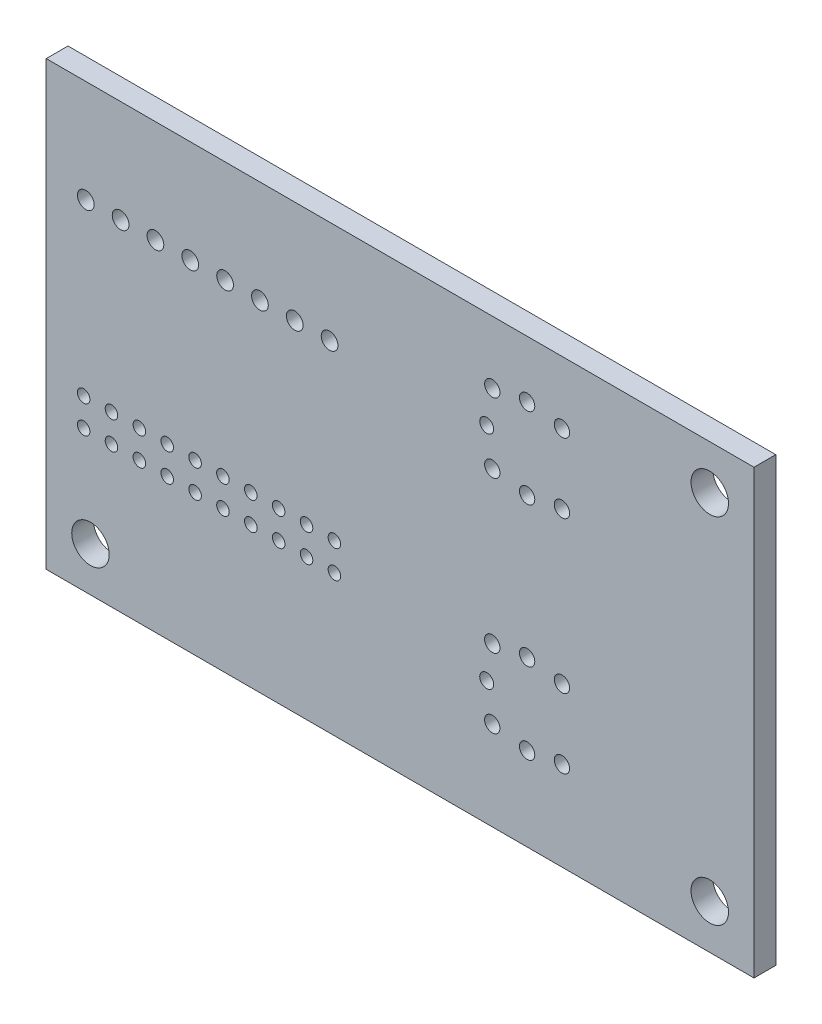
ISO-10303-21;
HEADER;
FILE_DESCRIPTION(('STEP AP214'),'2;1');
FILE_NAME('part.step','',(''),(''),'','','');
FILE_SCHEMA(('AUTOMOTIVE_DESIGN { 1 0 10303 214 1 1 1 1 }'));
ENDSEC;
DATA;
#1=APPLICATION_CONTEXT('core data for automotive mechanical design processes');
#2=APPLICATION_PROTOCOL_DEFINITION('international standard','automotive_design',2000,#1);
#3=PRODUCT_CONTEXT('',#1,'mechanical');
#4=PRODUCT('Part','Part','',(#3));
#5=PRODUCT_RELATED_PRODUCT_CATEGORY('part','',(#4));
#6=PRODUCT_DEFINITION_FORMATION('','',#4);
#7=PRODUCT_DEFINITION_CONTEXT('part definition',#1,'design');
#8=PRODUCT_DEFINITION('design','',#6,#7);
#9=PRODUCT_DEFINITION_SHAPE('','',#8);
#10=(LENGTH_UNIT() NAMED_UNIT(*) SI_UNIT(.MILLI.,.METRE.));
#11=(NAMED_UNIT(*) PLANE_ANGLE_UNIT() SI_UNIT($,.RADIAN.));
#12=(NAMED_UNIT(*) SI_UNIT($,.STERADIAN.) SOLID_ANGLE_UNIT());
#13=UNCERTAINTY_MEASURE_WITH_UNIT(LENGTH_MEASURE(1.E-05),#10,'distance_accuracy_value','');
#14=(GEOMETRIC_REPRESENTATION_CONTEXT(3) GLOBAL_UNCERTAINTY_ASSIGNED_CONTEXT((#13)) GLOBAL_UNIT_ASSIGNED_CONTEXT((#10,
#11,#12)) REPRESENTATION_CONTEXT('',''));
#15=CARTESIAN_POINT('',(0.,0.,0.));
#16=DIRECTION('',(0.,0.,1.));
#17=DIRECTION('',(1.,0.,0.));
#18=AXIS2_PLACEMENT_3D('',#15,#16,#17);
#19=CARTESIAN_POINT('',(0.,0.,0.));
#20=DIRECTION('',(0.,0.,1.));
#21=DIRECTION('',(1.,0.,0.));
#22=AXIS2_PLACEMENT_3D('',#19,#20,#21);
#23=PLANE('',#22);
#24=CARTESIAN_POINT('',(201.4692,235.85859,0.));
#25=DIRECTION('',(0.,0.,-1.));
#26=DIRECTION('',(-1.,0.,0.));
#27=AXIS2_PLACEMENT_3D('',#24,#25,#26);
#28=CIRCLE('',#27,0.549999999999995);
#29=CARTESIAN_POINT('',(200.9192,235.85859,0.));
#30=VERTEX_POINT('',#29);
#31=EDGE_CURVE('E368',#30,#30,#28,.T.);
#32=ORIENTED_EDGE('',*,*,#31,.F.);
#33=EDGE_LOOP('',(#32));
#34=FACE_BOUND('',#33,.T.);
#35=CARTESIAN_POINT('',(201.4692,230.05859,0.));
#36=DIRECTION('',(0.,0.,-1.));
#37=DIRECTION('',(-1.,0.,0.));
#38=AXIS2_PLACEMENT_3D('',#35,#36,#37);
#39=CIRCLE('',#38,0.549999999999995);
#40=CARTESIAN_POINT('',(200.9192,230.05859,0.));
#41=VERTEX_POINT('',#40);
#42=EDGE_CURVE('E362',#41,#41,#39,.T.);
#43=ORIENTED_EDGE('',*,*,#42,.F.);
#44=EDGE_LOOP('',(#43));
#45=FACE_BOUND('',#44,.T.);
#46=CARTESIAN_POINT('',(203.9692,235.45859,0.));
#47=DIRECTION('',(0.,0.,-1.));
#48=DIRECTION('',(-1.,0.,0.));
#49=AXIS2_PLACEMENT_3D('',#46,#47,#48);
#50=CIRCLE('',#49,0.549999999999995);
#51=CARTESIAN_POINT('',(203.4192,235.45859,0.));
#52=VERTEX_POINT('',#51);
#53=EDGE_CURVE('E356',#52,#52,#50,.T.);
#54=ORIENTED_EDGE('',*,*,#53,.F.);
#55=EDGE_LOOP('',(#54));
#56=FACE_BOUND('',#55,.T.);
#57=CARTESIAN_POINT('',(203.9692,230.45859,0.));
#58=DIRECTION('',(0.,0.,-1.));
#59=DIRECTION('',(-1.,0.,0.));
#60=AXIS2_PLACEMENT_3D('',#57,#58,#59);
#61=CIRCLE('',#60,0.549999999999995);
#62=CARTESIAN_POINT('',(203.4192,230.45859,0.));
#63=VERTEX_POINT('',#62);
#64=EDGE_CURVE('E350',#63,#63,#61,.T.);
#65=ORIENTED_EDGE('',*,*,#64,.F.);
#66=EDGE_LOOP('',(#65));
#67=FACE_BOUND('',#66,.T.);
#68=CARTESIAN_POINT('',(198.9692,235.45859,0.));
#69=DIRECTION('',(0.,0.,-1.));
#70=DIRECTION('',(-1.,0.,0.));
#71=AXIS2_PLACEMENT_3D('',#68,#69,#70);
#72=CIRCLE('',#71,0.549999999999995);
#73=CARTESIAN_POINT('',(198.4192,235.45859,0.));
#74=VERTEX_POINT('',#73);
#75=EDGE_CURVE('E344',#74,#74,#72,.T.);
#76=ORIENTED_EDGE('',*,*,#75,.F.);
#77=EDGE_LOOP('',(#76));
#78=FACE_BOUND('',#77,.T.);
#79=CARTESIAN_POINT('',(198.9692,214.58859,0.));
#80=DIRECTION('',(0.,0.,-1.));
#81=DIRECTION('',(-1.,0.,0.));
#82=AXIS2_PLACEMENT_3D('',#79,#80,#81);
#83=CIRCLE('',#82,0.549999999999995);
#84=CARTESIAN_POINT('',(198.4192,214.58859,0.));
#85=VERTEX_POINT('',#84);
#86=EDGE_CURVE('E320',#85,#85,#83,.T.);
#87=ORIENTED_EDGE('',*,*,#86,.F.);
#88=EDGE_LOOP('',(#87));
#89=FACE_BOUND('',#88,.T.);
#90=CARTESIAN_POINT('',(198.9692,219.58859,0.));
#91=DIRECTION('',(0.,0.,-1.));
#92=DIRECTION('',(-1.,0.,0.));
#93=AXIS2_PLACEMENT_3D('',#90,#91,#92);
#94=CIRCLE('',#93,0.549999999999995);
#95=CARTESIAN_POINT('',(198.4192,219.58859,0.));
#96=VERTEX_POINT('',#95);
#97=EDGE_CURVE('E314',#96,#96,#94,.T.);
#98=ORIENTED_EDGE('',*,*,#97,.F.);
#99=EDGE_LOOP('',(#98));
#100=FACE_BOUND('',#99,.T.);
#101=CARTESIAN_POINT('',(203.9692,214.58859,0.));
#102=DIRECTION('',(0.,0.,-1.));
#103=DIRECTION('',(-1.,0.,0.));
#104=AXIS2_PLACEMENT_3D('',#101,#102,#103);
#105=CIRCLE('',#104,0.549999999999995);
#106=CARTESIAN_POINT('',(203.4192,214.58859,0.));
#107=VERTEX_POINT('',#106);
#108=EDGE_CURVE('E308',#107,#107,#105,.T.);
#109=ORIENTED_EDGE('',*,*,#108,.F.);
#110=EDGE_LOOP('',(#109));
#111=FACE_BOUND('',#110,.T.);
#112=CARTESIAN_POINT('',(203.9692,219.58859,0.));
#113=DIRECTION('',(0.,0.,-1.));
#114=DIRECTION('',(-1.,0.,0.));
#115=AXIS2_PLACEMENT_3D('',#112,#113,#114);
#116=CIRCLE('',#115,0.549999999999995);
#117=CARTESIAN_POINT('',(203.4192,219.58859,0.));
#118=VERTEX_POINT('',#117);
#119=EDGE_CURVE('E302',#118,#118,#116,.T.);
#120=ORIENTED_EDGE('',*,*,#119,.F.);
#121=EDGE_LOOP('',(#120));
#122=FACE_BOUND('',#121,.T.);
#123=CARTESIAN_POINT('',(201.4692,214.18859,0.));
#124=DIRECTION('',(0.,0.,-1.));
#125=DIRECTION('',(-1.,0.,0.));
#126=AXIS2_PLACEMENT_3D('',#123,#124,#125);
#127=CIRCLE('',#126,0.549999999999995);
#128=CARTESIAN_POINT('',(200.9192,214.18859,0.));
#129=VERTEX_POINT('',#128);
#130=EDGE_CURVE('E296',#129,#129,#127,.T.);
#131=ORIENTED_EDGE('',*,*,#130,.F.);
#132=EDGE_LOOP('',(#131));
#133=FACE_BOUND('',#132,.T.);
#134=CARTESIAN_POINT('',(187.6382,218.31879,0.));
#135=DIRECTION('',(0.,0.,-1.));
#136=DIRECTION('',(-1.,0.,0.));
#137=AXIS2_PLACEMENT_3D('',#134,#135,#136);
#138=CIRCLE('',#137,0.449999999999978);
#139=CARTESIAN_POINT('',(187.1882,218.31879,0.));
#140=VERTEX_POINT('',#139);
#141=EDGE_CURVE('E284',#140,#140,#138,.T.);
#142=ORIENTED_EDGE('',*,*,#141,.F.);
#143=EDGE_LOOP('',(#142));
#144=FACE_BOUND('',#143,.T.);
#145=CARTESIAN_POINT('',(185.6382,218.31879,0.));
#146=DIRECTION('',(0.,0.,-1.));
#147=DIRECTION('',(-1.,0.,0.));
#148=AXIS2_PLACEMENT_3D('',#145,#146,#147);
#149=CIRCLE('',#148,0.449999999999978);
#150=CARTESIAN_POINT('',(185.1882,218.31879,0.));
#151=VERTEX_POINT('',#150);
#152=EDGE_CURVE('E278',#151,#151,#149,.T.);
#153=ORIENTED_EDGE('',*,*,#152,.F.);
#154=EDGE_LOOP('',(#153));
#155=FACE_BOUND('',#154,.T.);
#156=CARTESIAN_POINT('',(183.6382,218.31879,0.));
#157=DIRECTION('',(0.,0.,-1.));
#158=DIRECTION('',(-1.,0.,0.));
#159=AXIS2_PLACEMENT_3D('',#156,#157,#158);
#160=CIRCLE('',#159,0.449999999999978);
#161=CARTESIAN_POINT('',(183.1882,218.31879,0.));
#162=VERTEX_POINT('',#161);
#163=EDGE_CURVE('E272',#162,#162,#160,.T.);
#164=ORIENTED_EDGE('',*,*,#163,.F.);
#165=EDGE_LOOP('',(#164));
#166=FACE_BOUND('',#165,.T.);
#167=CARTESIAN_POINT('',(181.6382,218.31879,0.));
#168=DIRECTION('',(0.,0.,-1.));
#169=DIRECTION('',(-1.,0.,0.));
#170=AXIS2_PLACEMENT_3D('',#167,#168,#169);
#171=CIRCLE('',#170,0.449999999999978);
#172=CARTESIAN_POINT('',(181.1882,218.31879,0.));
#173=VERTEX_POINT('',#172);
#174=EDGE_CURVE('E266',#173,#173,#171,.T.);
#175=ORIENTED_EDGE('',*,*,#174,.F.);
#176=EDGE_LOOP('',(#175));
#177=FACE_BOUND('',#176,.T.);
#178=CARTESIAN_POINT('',(179.6382,218.31879,0.));
#179=DIRECTION('',(0.,0.,-1.));
#180=DIRECTION('',(-1.,0.,0.));
#181=AXIS2_PLACEMENT_3D('',#178,#179,#180);
#182=CIRCLE('',#181,0.449999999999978);
#183=CARTESIAN_POINT('',(179.1882,218.31879,0.));
#184=VERTEX_POINT('',#183);
#185=EDGE_CURVE('E260',#184,#184,#182,.T.);
#186=ORIENTED_EDGE('',*,*,#185,.F.);
#187=EDGE_LOOP('',(#186));
#188=FACE_BOUND('',#187,.T.);
#189=CARTESIAN_POINT('',(177.6382,218.31879,0.));
#190=DIRECTION('',(0.,0.,-1.));
#191=DIRECTION('',(-1.,0.,0.));
#192=AXIS2_PLACEMENT_3D('',#189,#190,#191);
#193=CIRCLE('',#192,0.449999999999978);
#194=CARTESIAN_POINT('',(177.1882,218.31879,0.));
#195=VERTEX_POINT('',#194);
#196=EDGE_CURVE('E254',#195,#195,#193,.T.);
#197=ORIENTED_EDGE('',*,*,#196,.F.);
#198=EDGE_LOOP('',(#197));
#199=FACE_BOUND('',#198,.T.);
#200=CARTESIAN_POINT('',(175.6382,218.31879,0.));
#201=DIRECTION('',(0.,0.,-1.));
#202=DIRECTION('',(-1.,0.,0.));
#203=AXIS2_PLACEMENT_3D('',#200,#201,#202);
#204=CIRCLE('',#203,0.449999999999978);
#205=CARTESIAN_POINT('',(175.1882,218.31879,0.));
#206=VERTEX_POINT('',#205);
#207=EDGE_CURVE('E248',#206,#206,#204,.T.);
#208=ORIENTED_EDGE('',*,*,#207,.F.);
#209=EDGE_LOOP('',(#208));
#210=FACE_BOUND('',#209,.T.);
#211=CARTESIAN_POINT('',(173.6382,218.31879,0.));
#212=DIRECTION('',(0.,0.,-1.));
#213=DIRECTION('',(-1.,0.,0.));
#214=AXIS2_PLACEMENT_3D('',#211,#212,#213);
#215=CIRCLE('',#214,0.449999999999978);
#216=CARTESIAN_POINT('',(173.1882,218.31879,0.));
#217=VERTEX_POINT('',#216);
#218=EDGE_CURVE('E242',#217,#217,#215,.T.);
#219=ORIENTED_EDGE('',*,*,#218,.F.);
#220=EDGE_LOOP('',(#219));
#221=FACE_BOUND('',#220,.T.);
#222=CARTESIAN_POINT('',(171.6382,218.31879,0.));
#223=DIRECTION('',(0.,0.,-1.));
#224=DIRECTION('',(-1.,0.,0.));
#225=AXIS2_PLACEMENT_3D('',#222,#223,#224);
#226=CIRCLE('',#225,0.449999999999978);
#227=CARTESIAN_POINT('',(171.1882,218.31879,0.));
#228=VERTEX_POINT('',#227);
#229=EDGE_CURVE('E236',#228,#228,#226,.T.);
#230=ORIENTED_EDGE('',*,*,#229,.F.);
#231=EDGE_LOOP('',(#230));
#232=FACE_BOUND('',#231,.T.);
#233=CARTESIAN_POINT('',(169.6382,218.31879,0.));
#234=DIRECTION('',(0.,0.,-1.));
#235=DIRECTION('',(-1.,0.,0.));
#236=AXIS2_PLACEMENT_3D('',#233,#234,#235);
#237=CIRCLE('',#236,0.449999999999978);
#238=CARTESIAN_POINT('',(169.1882,218.31879,0.));
#239=VERTEX_POINT('',#238);
#240=EDGE_CURVE('E230',#239,#239,#237,.T.);
#241=ORIENTED_EDGE('',*,*,#240,.F.);
#242=EDGE_LOOP('',(#241));
#243=FACE_BOUND('',#242,.T.);
#244=CARTESIAN_POINT('',(187.6382,220.31879,0.));
#245=DIRECTION('',(0.,0.,-1.));
#246=DIRECTION('',(-1.,0.,0.));
#247=AXIS2_PLACEMENT_3D('',#244,#245,#246);
#248=CIRCLE('',#247,0.449999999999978);
#249=CARTESIAN_POINT('',(187.1882,220.31879,0.));
#250=VERTEX_POINT('',#249);
#251=EDGE_CURVE('E224',#250,#250,#248,.T.);
#252=ORIENTED_EDGE('',*,*,#251,.F.);
#253=EDGE_LOOP('',(#252));
#254=FACE_BOUND('',#253,.T.);
#255=CARTESIAN_POINT('',(185.6382,220.31879,0.));
#256=DIRECTION('',(0.,0.,-1.));
#257=DIRECTION('',(-1.,0.,0.));
#258=AXIS2_PLACEMENT_3D('',#255,#256,#257);
#259=CIRCLE('',#258,0.449999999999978);
#260=CARTESIAN_POINT('',(185.1882,220.31879,0.));
#261=VERTEX_POINT('',#260);
#262=EDGE_CURVE('E218',#261,#261,#259,.T.);
#263=ORIENTED_EDGE('',*,*,#262,.F.);
#264=EDGE_LOOP('',(#263));
#265=FACE_BOUND('',#264,.T.);
#266=CARTESIAN_POINT('',(183.6382,220.31879,0.));
#267=DIRECTION('',(0.,0.,-1.));
#268=DIRECTION('',(-1.,0.,0.));
#269=AXIS2_PLACEMENT_3D('',#266,#267,#268);
#270=CIRCLE('',#269,0.449999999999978);
#271=CARTESIAN_POINT('',(183.1882,220.31879,0.));
#272=VERTEX_POINT('',#271);
#273=EDGE_CURVE('E212',#272,#272,#270,.T.);
#274=ORIENTED_EDGE('',*,*,#273,.F.);
#275=EDGE_LOOP('',(#274));
#276=FACE_BOUND('',#275,.T.);
#277=CARTESIAN_POINT('',(181.6382,220.31879,0.));
#278=DIRECTION('',(0.,0.,-1.));
#279=DIRECTION('',(-1.,0.,0.));
#280=AXIS2_PLACEMENT_3D('',#277,#278,#279);
#281=CIRCLE('',#280,0.449999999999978);
#282=CARTESIAN_POINT('',(181.1882,220.31879,0.));
#283=VERTEX_POINT('',#282);
#284=EDGE_CURVE('E206',#283,#283,#281,.T.);
#285=ORIENTED_EDGE('',*,*,#284,.F.);
#286=EDGE_LOOP('',(#285));
#287=FACE_BOUND('',#286,.T.);
#288=CARTESIAN_POINT('',(179.6382,220.31879,0.));
#289=DIRECTION('',(0.,0.,-1.));
#290=DIRECTION('',(-1.,0.,0.));
#291=AXIS2_PLACEMENT_3D('',#288,#289,#290);
#292=CIRCLE('',#291,0.449999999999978);
#293=CARTESIAN_POINT('',(179.1882,220.31879,0.));
#294=VERTEX_POINT('',#293);
#295=EDGE_CURVE('E200',#294,#294,#292,.T.);
#296=ORIENTED_EDGE('',*,*,#295,.F.);
#297=EDGE_LOOP('',(#296));
#298=FACE_BOUND('',#297,.T.);
#299=CARTESIAN_POINT('',(177.6382,220.31879,0.));
#300=DIRECTION('',(0.,0.,-1.));
#301=DIRECTION('',(-1.,0.,0.));
#302=AXIS2_PLACEMENT_3D('',#299,#300,#301);
#303=CIRCLE('',#302,0.449999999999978);
#304=CARTESIAN_POINT('',(177.1882,220.31879,0.));
#305=VERTEX_POINT('',#304);
#306=EDGE_CURVE('E194',#305,#305,#303,.T.);
#307=ORIENTED_EDGE('',*,*,#306,.F.);
#308=EDGE_LOOP('',(#307));
#309=FACE_BOUND('',#308,.T.);
#310=CARTESIAN_POINT('',(175.6382,220.31879,0.));
#311=DIRECTION('',(0.,0.,-1.));
#312=DIRECTION('',(-1.,0.,0.));
#313=AXIS2_PLACEMENT_3D('',#310,#311,#312);
#314=CIRCLE('',#313,0.449999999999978);
#315=CARTESIAN_POINT('',(175.1882,220.31879,0.));
#316=VERTEX_POINT('',#315);
#317=EDGE_CURVE('E188',#316,#316,#314,.T.);
#318=ORIENTED_EDGE('',*,*,#317,.F.);
#319=EDGE_LOOP('',(#318));
#320=FACE_BOUND('',#319,.T.);
#321=CARTESIAN_POINT('',(173.6382,220.31879,0.));
#322=DIRECTION('',(0.,0.,-1.));
#323=DIRECTION('',(-1.,0.,0.));
#324=AXIS2_PLACEMENT_3D('',#321,#322,#323);
#325=CIRCLE('',#324,0.449999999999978);
#326=CARTESIAN_POINT('',(173.1882,220.31879,0.));
#327=VERTEX_POINT('',#326);
#328=EDGE_CURVE('E182',#327,#327,#325,.T.);
#329=ORIENTED_EDGE('',*,*,#328,.F.);
#330=EDGE_LOOP('',(#329));
#331=FACE_BOUND('',#330,.T.);
#332=CARTESIAN_POINT('',(171.6382,220.31879,0.));
#333=DIRECTION('',(0.,0.,-1.));
#334=DIRECTION('',(-1.,0.,0.));
#335=AXIS2_PLACEMENT_3D('',#332,#333,#334);
#336=CIRCLE('',#335,0.449999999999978);
#337=CARTESIAN_POINT('',(171.1882,220.31879,0.));
#338=VERTEX_POINT('',#337);
#339=EDGE_CURVE('E176',#338,#338,#336,.T.);
#340=ORIENTED_EDGE('',*,*,#339,.F.);
#341=EDGE_LOOP('',(#340));
#342=FACE_BOUND('',#341,.T.);
#343=CARTESIAN_POINT('',(169.6382,220.31879,0.));
#344=DIRECTION('',(0.,0.,-1.));
#345=DIRECTION('',(-1.,0.,0.));
#346=AXIS2_PLACEMENT_3D('',#343,#344,#345);
#347=CIRCLE('',#346,0.449999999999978);
#348=CARTESIAN_POINT('',(169.1882,220.31879,0.));
#349=VERTEX_POINT('',#348);
#350=EDGE_CURVE('E170',#349,#349,#347,.T.);
#351=ORIENTED_EDGE('',*,*,#350,.F.);
#352=EDGE_LOOP('',(#351));
#353=FACE_BOUND('',#352,.T.);
#354=CARTESIAN_POINT('',(187.292,232.57759,0.));
#355=DIRECTION('',(0.,0.,-1.));
#356=DIRECTION('',(-1.,0.,0.));
#357=AXIS2_PLACEMENT_3D('',#354,#355,#356);
#358=CIRCLE('',#357,0.599999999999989);
#359=CARTESIAN_POINT('',(186.692,232.57759,0.));
#360=VERTEX_POINT('',#359);
#361=EDGE_CURVE('E164',#360,#360,#358,.T.);
#362=ORIENTED_EDGE('',*,*,#361,.F.);
#363=EDGE_LOOP('',(#362));
#364=FACE_BOUND('',#363,.T.);
#365=CARTESIAN_POINT('',(184.792,232.57759,0.));
#366=DIRECTION('',(0.,0.,-1.));
#367=DIRECTION('',(-1.,0.,0.));
#368=AXIS2_PLACEMENT_3D('',#365,#366,#367);
#369=CIRCLE('',#368,0.599999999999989);
#370=CARTESIAN_POINT('',(184.192,232.57759,0.));
#371=VERTEX_POINT('',#370);
#372=EDGE_CURVE('E158',#371,#371,#369,.T.);
#373=ORIENTED_EDGE('',*,*,#372,.F.);
#374=EDGE_LOOP('',(#373));
#375=FACE_BOUND('',#374,.T.);
#376=CARTESIAN_POINT('',(182.292,232.57759,0.));
#377=DIRECTION('',(0.,0.,-1.));
#378=DIRECTION('',(-1.,0.,0.));
#379=AXIS2_PLACEMENT_3D('',#376,#377,#378);
#380=CIRCLE('',#379,0.599999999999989);
#381=CARTESIAN_POINT('',(181.692,232.57759,0.));
#382=VERTEX_POINT('',#381);
#383=EDGE_CURVE('E152',#382,#382,#380,.T.);
#384=ORIENTED_EDGE('',*,*,#383,.F.);
#385=EDGE_LOOP('',(#384));
#386=FACE_BOUND('',#385,.T.);
#387=CARTESIAN_POINT('',(179.792,232.57759,0.));
#388=DIRECTION('',(0.,0.,-1.));
#389=DIRECTION('',(-1.,0.,0.));
#390=AXIS2_PLACEMENT_3D('',#387,#388,#389);
#391=CIRCLE('',#390,0.599999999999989);
#392=CARTESIAN_POINT('',(179.192,232.57759,0.));
#393=VERTEX_POINT('',#392);
#394=EDGE_CURVE('E146',#393,#393,#391,.T.);
#395=ORIENTED_EDGE('',*,*,#394,.F.);
#396=EDGE_LOOP('',(#395));
#397=FACE_BOUND('',#396,.T.);
#398=CARTESIAN_POINT('',(177.292,232.57759,0.));
#399=DIRECTION('',(0.,0.,-1.));
#400=DIRECTION('',(-1.,0.,0.));
#401=AXIS2_PLACEMENT_3D('',#398,#399,#400);
#402=CIRCLE('',#401,0.599999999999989);
#403=CARTESIAN_POINT('',(176.692,232.57759,0.));
#404=VERTEX_POINT('',#403);
#405=EDGE_CURVE('E140',#404,#404,#402,.T.);
#406=ORIENTED_EDGE('',*,*,#405,.F.);
#407=EDGE_LOOP('',(#406));
#408=FACE_BOUND('',#407,.T.);
#409=CARTESIAN_POINT('',(174.792,232.57759,0.));
#410=DIRECTION('',(0.,0.,-1.));
#411=DIRECTION('',(-1.,0.,0.));
#412=AXIS2_PLACEMENT_3D('',#409,#410,#411);
#413=CIRCLE('',#412,0.599999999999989);
#414=CARTESIAN_POINT('',(174.192,232.57759,0.));
#415=VERTEX_POINT('',#414);
#416=EDGE_CURVE('E134',#415,#415,#413,.T.);
#417=ORIENTED_EDGE('',*,*,#416,.F.);
#418=EDGE_LOOP('',(#417));
#419=FACE_BOUND('',#418,.T.);
#420=CARTESIAN_POINT('',(172.292,232.57759,0.));
#421=DIRECTION('',(0.,0.,-1.));
#422=DIRECTION('',(-1.,0.,0.));
#423=AXIS2_PLACEMENT_3D('',#420,#421,#422);
#424=CIRCLE('',#423,0.599999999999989);
#425=CARTESIAN_POINT('',(171.692,232.57759,0.));
#426=VERTEX_POINT('',#425);
#427=EDGE_CURVE('E128',#426,#426,#424,.T.);
#428=ORIENTED_EDGE('',*,*,#427,.F.);
#429=EDGE_LOOP('',(#428));
#430=FACE_BOUND('',#429,.T.);
#431=CARTESIAN_POINT('',(169.792,232.57759,0.));
#432=DIRECTION('',(0.,0.,-1.));
#433=DIRECTION('',(-1.,0.,0.));
#434=AXIS2_PLACEMENT_3D('',#431,#432,#433);
#435=CIRCLE('',#434,0.599999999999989);
#436=CARTESIAN_POINT('',(169.192,232.57759,0.));
#437=VERTEX_POINT('',#436);
#438=EDGE_CURVE('E122',#437,#437,#435,.T.);
#439=ORIENTED_EDGE('',*,*,#438,.F.);
#440=EDGE_LOOP('',(#439));
#441=FACE_BOUND('',#440,.T.);
#442=DIRECTION('',(0.,-1.,0.));
#443=VECTOR('',#442,1.);
#444=CARTESIAN_POINT('',(166.9542,239.94359,0.));
#445=LINE('',#444,#443);
#446=CARTESIAN_POINT('',(166.9542,239.94359,0.));
#447=VERTEX_POINT('',#446);
#448=CARTESIAN_POINT('',(166.9542,208.19359,0.));
#449=VERTEX_POINT('',#448);
#450=EDGE_CURVE('E106',#447,#449,#445,.T.);
#451=ORIENTED_EDGE('',*,*,#450,.F.);
#452=DIRECTION('',(-1.,0.,0.));
#453=VECTOR('',#452,1.);
#454=CARTESIAN_POINT('',(217.7542,239.94359,0.));
#455=LINE('',#454,#453);
#456=CARTESIAN_POINT('',(217.7542,239.94359,0.));
#457=VERTEX_POINT('',#456);
#458=EDGE_CURVE('E81',#457,#447,#455,.T.);
#459=ORIENTED_EDGE('',*,*,#458,.F.);
#460=DIRECTION('',(0.,1.,0.));
#461=VECTOR('',#460,1.);
#462=CARTESIAN_POINT('',(217.7542,208.19359,0.));
#463=LINE('',#462,#461);
#464=CARTESIAN_POINT('',(217.7542,208.19359,0.));
#465=VERTEX_POINT('',#464);
#466=EDGE_CURVE('E75',#465,#457,#463,.T.);
#467=ORIENTED_EDGE('',*,*,#466,.F.);
#468=DIRECTION('',(1.,0.,0.));
#469=VECTOR('',#468,1.);
#470=CARTESIAN_POINT('',(166.9542,208.19359,0.));
#471=LINE('',#470,#469);
#472=EDGE_CURVE('E98',#449,#465,#471,.T.);
#473=ORIENTED_EDGE('',*,*,#472,.F.);
#474=EDGE_LOOP('',(#451,#459,#467,#473));
#475=FACE_BOUND('',#474,.T.);
#476=CARTESIAN_POINT('',(201.4692,219.98859,0.));
#477=DIRECTION('',(0.,0.,-1.));
#478=DIRECTION('',(-1.,0.,0.));
#479=AXIS2_PLACEMENT_3D('',#476,#477,#478);
#480=CIRCLE('',#479,0.549999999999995);
#481=CARTESIAN_POINT('',(200.9192,219.98859,0.));
#482=VERTEX_POINT('',#481);
#483=EDGE_CURVE('E290',#482,#482,#480,.T.);
#484=ORIENTED_EDGE('',*,*,#483,.F.);
#485=EDGE_LOOP('',(#484));
#486=FACE_BOUND('',#485,.T.);
#487=CARTESIAN_POINT('',(198.5692,217.08859,0.));
#488=DIRECTION('',(0.,0.,-1.));
#489=DIRECTION('',(-1.,0.,0.));
#490=AXIS2_PLACEMENT_3D('',#487,#488,#489);
#491=CIRCLE('',#490,0.5);
#492=CARTESIAN_POINT('',(198.0692,217.08859,0.));
#493=VERTEX_POINT('',#492);
#494=EDGE_CURVE('E326',#493,#493,#491,.T.);
#495=ORIENTED_EDGE('',*,*,#494,.F.);
#496=EDGE_LOOP('',(#495));
#497=FACE_BOUND('',#496,.T.);
#498=CARTESIAN_POINT('',(198.5692,232.95859,0.));
#499=DIRECTION('',(0.,0.,-1.));
#500=DIRECTION('',(-1.,0.,0.));
#501=AXIS2_PLACEMENT_3D('',#498,#499,#500);
#502=CIRCLE('',#501,0.5);
#503=CARTESIAN_POINT('',(198.0692,232.95859,0.));
#504=VERTEX_POINT('',#503);
#505=EDGE_CURVE('E332',#504,#504,#502,.T.);
#506=ORIENTED_EDGE('',*,*,#505,.F.);
#507=EDGE_LOOP('',(#506));
#508=FACE_BOUND('',#507,.T.);
#509=CARTESIAN_POINT('',(198.9692,230.45859,0.));
#510=DIRECTION('',(0.,0.,-1.));
#511=DIRECTION('',(-1.,0.,0.));
#512=AXIS2_PLACEMENT_3D('',#509,#510,#511);
#513=CIRCLE('',#512,0.549999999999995);
#514=CARTESIAN_POINT('',(198.4192,230.45859,0.));
#515=VERTEX_POINT('',#514);
#516=EDGE_CURVE('E338',#515,#515,#513,.T.);
#517=ORIENTED_EDGE('',*,*,#516,.F.);
#518=EDGE_LOOP('',(#517));
#519=FACE_BOUND('',#518,.T.);
#520=CARTESIAN_POINT('',(214.5792,211.36859,0.));
#521=DIRECTION('',(0.,0.,-1.));
#522=DIRECTION('',(-1.,0.,0.));
#523=AXIS2_PLACEMENT_3D('',#520,#521,#522);
#524=CIRCLE('',#523,1.34499999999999);
#525=CARTESIAN_POINT('',(213.2342,211.36859,0.));
#526=VERTEX_POINT('',#525);
#527=EDGE_CURVE('E374',#526,#526,#524,.T.);
#528=ORIENTED_EDGE('',*,*,#527,.F.);
#529=EDGE_LOOP('',(#528));
#530=FACE_BOUND('',#529,.T.);
#531=CARTESIAN_POINT('',(170.1292,211.36859,0.));
#532=DIRECTION('',(0.,0.,-1.));
#533=DIRECTION('',(-1.,0.,0.));
#534=AXIS2_PLACEMENT_3D('',#531,#532,#533);
#535=CIRCLE('',#534,1.34499999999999);
#536=CARTESIAN_POINT('',(168.7842,211.36859,0.));
#537=VERTEX_POINT('',#536);
#538=EDGE_CURVE('E380',#537,#537,#535,.T.);
#539=ORIENTED_EDGE('',*,*,#538,.F.);
#540=EDGE_LOOP('',(#539));
#541=FACE_BOUND('',#540,.T.);
#542=CARTESIAN_POINT('',(214.5792,236.76859,0.));
#543=DIRECTION('',(0.,0.,-1.));
#544=DIRECTION('',(-1.,0.,0.));
#545=AXIS2_PLACEMENT_3D('',#542,#543,#544);
#546=CIRCLE('',#545,1.34499999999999);
#547=CARTESIAN_POINT('',(213.2342,236.76859,0.));
#548=VERTEX_POINT('',#547);
#549=EDGE_CURVE('E386',#548,#548,#546,.T.);
#550=ORIENTED_EDGE('',*,*,#549,.F.);
#551=EDGE_LOOP('',(#550));
#552=FACE_BOUND('',#551,.T.);
#553=ADVANCED_FACE('F41',(#34,#45,#56,#67,#78,#89,#100,#111,#122,#133,#144,#155,#166,#177,#188,
#199,#210,#221,#232,#243,#254,#265,#276,#287,#298,#309,#320,#331,#342,#353,#364,#375,#386,#397,
#408,#419,#430,#441,#475,#486,#497,#508,#519,#530,#541,#552),#23,.F.);
#554=CARTESIAN_POINT('',(0.,0.,1.56352));
#555=DIRECTION('',(0.,0.,1.));
#556=DIRECTION('',(1.,0.,0.));
#557=AXIS2_PLACEMENT_3D('',#554,#555,#556);
#558=PLANE('',#557);
#559=CARTESIAN_POINT('',(170.1292,211.36859,1.56352));
#560=DIRECTION('',(0.,0.,-1.));
#561=DIRECTION('',(-1.,0.,0.));
#562=AXIS2_PLACEMENT_3D('',#559,#560,#561);
#563=CIRCLE('',#562,1.34499999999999);
#564=CARTESIAN_POINT('',(168.7842,211.36859,1.56352));
#565=VERTEX_POINT('',#564);
#566=EDGE_CURVE('E377',#565,#565,#563,.T.);
#567=ORIENTED_EDGE('',*,*,#566,.T.);
#568=EDGE_LOOP('',(#567));
#569=FACE_BOUND('',#568,.T.);
#570=CARTESIAN_POINT('',(198.9692,230.45859,1.56352));
#571=DIRECTION('',(0.,0.,-1.));
#572=DIRECTION('',(-1.,0.,0.));
#573=AXIS2_PLACEMENT_3D('',#570,#571,#572);
#574=CIRCLE('',#573,0.549999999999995);
#575=CARTESIAN_POINT('',(198.4192,230.45859,1.56352));
#576=VERTEX_POINT('',#575);
#577=EDGE_CURVE('E335',#576,#576,#574,.T.);
#578=ORIENTED_EDGE('',*,*,#577,.T.);
#579=EDGE_LOOP('',(#578));
#580=FACE_BOUND('',#579,.T.);
#581=CARTESIAN_POINT('',(198.5692,217.08859,1.56352));
#582=DIRECTION('',(0.,0.,-1.));
#583=DIRECTION('',(-1.,0.,0.));
#584=AXIS2_PLACEMENT_3D('',#581,#582,#583);
#585=CIRCLE('',#584,0.5);
#586=CARTESIAN_POINT('',(198.0692,217.08859,1.56352));
#587=VERTEX_POINT('',#586);
#588=EDGE_CURVE('E323',#587,#587,#585,.T.);
#589=ORIENTED_EDGE('',*,*,#588,.T.);
#590=EDGE_LOOP('',(#589));
#591=FACE_BOUND('',#590,.T.);
#592=CARTESIAN_POINT('',(198.9692,214.58859,1.56352));
#593=DIRECTION('',(0.,0.,-1.));
#594=DIRECTION('',(-1.,0.,0.));
#595=AXIS2_PLACEMENT_3D('',#592,#593,#594);
#596=CIRCLE('',#595,0.549999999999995);
#597=CARTESIAN_POINT('',(198.4192,214.58859,1.56352));
#598=VERTEX_POINT('',#597);
#599=EDGE_CURVE('E317',#598,#598,#596,.T.);
#600=ORIENTED_EDGE('',*,*,#599,.T.);
#601=EDGE_LOOP('',(#600));
#602=FACE_BOUND('',#601,.T.);
#603=CARTESIAN_POINT('',(198.9692,219.58859,1.56352));
#604=DIRECTION('',(0.,0.,-1.));
#605=DIRECTION('',(-1.,0.,0.));
#606=AXIS2_PLACEMENT_3D('',#603,#604,#605);
#607=CIRCLE('',#606,0.549999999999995);
#608=CARTESIAN_POINT('',(198.4192,219.58859,1.56352));
#609=VERTEX_POINT('',#608);
#610=EDGE_CURVE('E311',#609,#609,#607,.T.);
#611=ORIENTED_EDGE('',*,*,#610,.T.);
#612=EDGE_LOOP('',(#611));
#613=FACE_BOUND('',#612,.T.);
#614=CARTESIAN_POINT('',(203.9692,214.58859,1.56352));
#615=DIRECTION('',(0.,0.,-1.));
#616=DIRECTION('',(-1.,0.,0.));
#617=AXIS2_PLACEMENT_3D('',#614,#615,#616);
#618=CIRCLE('',#617,0.549999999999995);
#619=CARTESIAN_POINT('',(203.4192,214.58859,1.56352));
#620=VERTEX_POINT('',#619);
#621=EDGE_CURVE('E305',#620,#620,#618,.T.);
#622=ORIENTED_EDGE('',*,*,#621,.T.);
#623=EDGE_LOOP('',(#622));
#624=FACE_BOUND('',#623,.T.);
#625=CARTESIAN_POINT('',(203.9692,219.58859,1.56352));
#626=DIRECTION('',(0.,0.,-1.));
#627=DIRECTION('',(-1.,0.,0.));
#628=AXIS2_PLACEMENT_3D('',#625,#626,#627);
#629=CIRCLE('',#628,0.549999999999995);
#630=CARTESIAN_POINT('',(203.4192,219.58859,1.56352));
#631=VERTEX_POINT('',#630);
#632=EDGE_CURVE('E299',#631,#631,#629,.T.);
#633=ORIENTED_EDGE('',*,*,#632,.T.);
#634=EDGE_LOOP('',(#633));
#635=FACE_BOUND('',#634,.T.);
#636=CARTESIAN_POINT('',(201.4692,214.18859,1.56352));
#637=DIRECTION('',(0.,0.,-1.));
#638=DIRECTION('',(-1.,0.,0.));
#639=AXIS2_PLACEMENT_3D('',#636,#637,#638);
#640=CIRCLE('',#639,0.549999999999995);
#641=CARTESIAN_POINT('',(200.9192,214.18859,1.56352));
#642=VERTEX_POINT('',#641);
#643=EDGE_CURVE('E293',#642,#642,#640,.T.);
#644=ORIENTED_EDGE('',*,*,#643,.T.);
#645=EDGE_LOOP('',(#644));
#646=FACE_BOUND('',#645,.T.);
#647=CARTESIAN_POINT('',(201.4692,219.98859,1.56352));
#648=DIRECTION('',(0.,0.,-1.));
#649=DIRECTION('',(-1.,0.,0.));
#650=AXIS2_PLACEMENT_3D('',#647,#648,#649);
#651=CIRCLE('',#650,0.549999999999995);
#652=CARTESIAN_POINT('',(200.9192,219.98859,1.56352));
#653=VERTEX_POINT('',#652);
#654=EDGE_CURVE('E287',#653,#653,#651,.T.);
#655=ORIENTED_EDGE('',*,*,#654,.T.);
#656=EDGE_LOOP('',(#655));
#657=FACE_BOUND('',#656,.T.);
#658=CARTESIAN_POINT('',(187.6382,218.31879,1.56352));
#659=DIRECTION('',(0.,0.,-1.));
#660=DIRECTION('',(-1.,0.,0.));
#661=AXIS2_PLACEMENT_3D('',#658,#659,#660);
#662=CIRCLE('',#661,0.449999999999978);
#663=CARTESIAN_POINT('',(187.1882,218.31879,1.56352));
#664=VERTEX_POINT('',#663);
#665=EDGE_CURVE('E281',#664,#664,#662,.T.);
#666=ORIENTED_EDGE('',*,*,#665,.T.);
#667=EDGE_LOOP('',(#666));
#668=FACE_BOUND('',#667,.T.);
#669=CARTESIAN_POINT('',(185.6382,218.31879,1.56352));
#670=DIRECTION('',(0.,0.,-1.));
#671=DIRECTION('',(-1.,0.,0.));
#672=AXIS2_PLACEMENT_3D('',#669,#670,#671);
#673=CIRCLE('',#672,0.449999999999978);
#674=CARTESIAN_POINT('',(185.1882,218.31879,1.56352));
#675=VERTEX_POINT('',#674);
#676=EDGE_CURVE('E275',#675,#675,#673,.T.);
#677=ORIENTED_EDGE('',*,*,#676,.T.);
#678=EDGE_LOOP('',(#677));
#679=FACE_BOUND('',#678,.T.);
#680=CARTESIAN_POINT('',(183.6382,218.31879,1.56352));
#681=DIRECTION('',(0.,0.,-1.));
#682=DIRECTION('',(-1.,0.,0.));
#683=AXIS2_PLACEMENT_3D('',#680,#681,#682);
#684=CIRCLE('',#683,0.449999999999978);
#685=CARTESIAN_POINT('',(183.1882,218.31879,1.56352));
#686=VERTEX_POINT('',#685);
#687=EDGE_CURVE('E269',#686,#686,#684,.T.);
#688=ORIENTED_EDGE('',*,*,#687,.T.);
#689=EDGE_LOOP('',(#688));
#690=FACE_BOUND('',#689,.T.);
#691=CARTESIAN_POINT('',(181.6382,218.31879,1.56352));
#692=DIRECTION('',(0.,0.,-1.));
#693=DIRECTION('',(-1.,0.,0.));
#694=AXIS2_PLACEMENT_3D('',#691,#692,#693);
#695=CIRCLE('',#694,0.449999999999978);
#696=CARTESIAN_POINT('',(181.1882,218.31879,1.56352));
#697=VERTEX_POINT('',#696);
#698=EDGE_CURVE('E263',#697,#697,#695,.T.);
#699=ORIENTED_EDGE('',*,*,#698,.T.);
#700=EDGE_LOOP('',(#699));
#701=FACE_BOUND('',#700,.T.);
#702=CARTESIAN_POINT('',(179.6382,218.31879,1.56352));
#703=DIRECTION('',(0.,0.,-1.));
#704=DIRECTION('',(-1.,0.,0.));
#705=AXIS2_PLACEMENT_3D('',#702,#703,#704);
#706=CIRCLE('',#705,0.449999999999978);
#707=CARTESIAN_POINT('',(179.1882,218.31879,1.56352));
#708=VERTEX_POINT('',#707);
#709=EDGE_CURVE('E257',#708,#708,#706,.T.);
#710=ORIENTED_EDGE('',*,*,#709,.T.);
#711=EDGE_LOOP('',(#710));
#712=FACE_BOUND('',#711,.T.);
#713=CARTESIAN_POINT('',(177.6382,218.31879,1.56352));
#714=DIRECTION('',(0.,0.,-1.));
#715=DIRECTION('',(-1.,0.,0.));
#716=AXIS2_PLACEMENT_3D('',#713,#714,#715);
#717=CIRCLE('',#716,0.449999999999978);
#718=CARTESIAN_POINT('',(177.1882,218.31879,1.56352));
#719=VERTEX_POINT('',#718);
#720=EDGE_CURVE('E251',#719,#719,#717,.T.);
#721=ORIENTED_EDGE('',*,*,#720,.T.);
#722=EDGE_LOOP('',(#721));
#723=FACE_BOUND('',#722,.T.);
#724=CARTESIAN_POINT('',(175.6382,218.31879,1.56352));
#725=DIRECTION('',(0.,0.,-1.));
#726=DIRECTION('',(-1.,0.,0.));
#727=AXIS2_PLACEMENT_3D('',#724,#725,#726);
#728=CIRCLE('',#727,0.449999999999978);
#729=CARTESIAN_POINT('',(175.1882,218.31879,1.56352));
#730=VERTEX_POINT('',#729);
#731=EDGE_CURVE('E245',#730,#730,#728,.T.);
#732=ORIENTED_EDGE('',*,*,#731,.T.);
#733=EDGE_LOOP('',(#732));
#734=FACE_BOUND('',#733,.T.);
#735=CARTESIAN_POINT('',(173.6382,218.31879,1.56352));
#736=DIRECTION('',(0.,0.,-1.));
#737=DIRECTION('',(-1.,0.,0.));
#738=AXIS2_PLACEMENT_3D('',#735,#736,#737);
#739=CIRCLE('',#738,0.449999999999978);
#740=CARTESIAN_POINT('',(173.1882,218.31879,1.56352));
#741=VERTEX_POINT('',#740);
#742=EDGE_CURVE('E239',#741,#741,#739,.T.);
#743=ORIENTED_EDGE('',*,*,#742,.T.);
#744=EDGE_LOOP('',(#743));
#745=FACE_BOUND('',#744,.T.);
#746=CARTESIAN_POINT('',(171.6382,218.31879,1.56352));
#747=DIRECTION('',(0.,0.,-1.));
#748=DIRECTION('',(-1.,0.,0.));
#749=AXIS2_PLACEMENT_3D('',#746,#747,#748);
#750=CIRCLE('',#749,0.449999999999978);
#751=CARTESIAN_POINT('',(171.1882,218.31879,1.56352));
#752=VERTEX_POINT('',#751);
#753=EDGE_CURVE('E233',#752,#752,#750,.T.);
#754=ORIENTED_EDGE('',*,*,#753,.T.);
#755=EDGE_LOOP('',(#754));
#756=FACE_BOUND('',#755,.T.);
#757=CARTESIAN_POINT('',(169.6382,218.31879,1.56352));
#758=DIRECTION('',(0.,0.,-1.));
#759=DIRECTION('',(-1.,0.,0.));
#760=AXIS2_PLACEMENT_3D('',#757,#758,#759);
#761=CIRCLE('',#760,0.449999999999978);
#762=CARTESIAN_POINT('',(169.1882,218.31879,1.56352));
#763=VERTEX_POINT('',#762);
#764=EDGE_CURVE('E227',#763,#763,#761,.T.);
#765=ORIENTED_EDGE('',*,*,#764,.T.);
#766=EDGE_LOOP('',(#765));
#767=FACE_BOUND('',#766,.T.);
#768=CARTESIAN_POINT('',(187.6382,220.31879,1.56352));
#769=DIRECTION('',(0.,0.,-1.));
#770=DIRECTION('',(-1.,0.,0.));
#771=AXIS2_PLACEMENT_3D('',#768,#769,#770);
#772=CIRCLE('',#771,0.449999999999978);
#773=CARTESIAN_POINT('',(187.1882,220.31879,1.56352));
#774=VERTEX_POINT('',#773);
#775=EDGE_CURVE('E221',#774,#774,#772,.T.);
#776=ORIENTED_EDGE('',*,*,#775,.T.);
#777=EDGE_LOOP('',(#776));
#778=FACE_BOUND('',#777,.T.);
#779=CARTESIAN_POINT('',(185.6382,220.31879,1.56352));
#780=DIRECTION('',(0.,0.,-1.));
#781=DIRECTION('',(-1.,0.,0.));
#782=AXIS2_PLACEMENT_3D('',#779,#780,#781);
#783=CIRCLE('',#782,0.449999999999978);
#784=CARTESIAN_POINT('',(185.1882,220.31879,1.56352));
#785=VERTEX_POINT('',#784);
#786=EDGE_CURVE('E215',#785,#785,#783,.T.);
#787=ORIENTED_EDGE('',*,*,#786,.T.);
#788=EDGE_LOOP('',(#787));
#789=FACE_BOUND('',#788,.T.);
#790=CARTESIAN_POINT('',(183.6382,220.31879,1.56352));
#791=DIRECTION('',(0.,0.,-1.));
#792=DIRECTION('',(-1.,0.,0.));
#793=AXIS2_PLACEMENT_3D('',#790,#791,#792);
#794=CIRCLE('',#793,0.449999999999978);
#795=CARTESIAN_POINT('',(183.1882,220.31879,1.56352));
#796=VERTEX_POINT('',#795);
#797=EDGE_CURVE('E209',#796,#796,#794,.T.);
#798=ORIENTED_EDGE('',*,*,#797,.T.);
#799=EDGE_LOOP('',(#798));
#800=FACE_BOUND('',#799,.T.);
#801=CARTESIAN_POINT('',(181.6382,220.31879,1.56352));
#802=DIRECTION('',(0.,0.,-1.));
#803=DIRECTION('',(-1.,0.,0.));
#804=AXIS2_PLACEMENT_3D('',#801,#802,#803);
#805=CIRCLE('',#804,0.449999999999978);
#806=CARTESIAN_POINT('',(181.1882,220.31879,1.56352));
#807=VERTEX_POINT('',#806);
#808=EDGE_CURVE('E203',#807,#807,#805,.T.);
#809=ORIENTED_EDGE('',*,*,#808,.T.);
#810=EDGE_LOOP('',(#809));
#811=FACE_BOUND('',#810,.T.);
#812=CARTESIAN_POINT('',(179.6382,220.31879,1.56352));
#813=DIRECTION('',(0.,0.,-1.));
#814=DIRECTION('',(-1.,0.,0.));
#815=AXIS2_PLACEMENT_3D('',#812,#813,#814);
#816=CIRCLE('',#815,0.449999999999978);
#817=CARTESIAN_POINT('',(179.1882,220.31879,1.56352));
#818=VERTEX_POINT('',#817);
#819=EDGE_CURVE('E197',#818,#818,#816,.T.);
#820=ORIENTED_EDGE('',*,*,#819,.T.);
#821=EDGE_LOOP('',(#820));
#822=FACE_BOUND('',#821,.T.);
#823=CARTESIAN_POINT('',(177.6382,220.31879,1.56352));
#824=DIRECTION('',(0.,0.,-1.));
#825=DIRECTION('',(-1.,0.,0.));
#826=AXIS2_PLACEMENT_3D('',#823,#824,#825);
#827=CIRCLE('',#826,0.449999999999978);
#828=CARTESIAN_POINT('',(177.1882,220.31879,1.56352));
#829=VERTEX_POINT('',#828);
#830=EDGE_CURVE('E191',#829,#829,#827,.T.);
#831=ORIENTED_EDGE('',*,*,#830,.T.);
#832=EDGE_LOOP('',(#831));
#833=FACE_BOUND('',#832,.T.);
#834=CARTESIAN_POINT('',(175.6382,220.31879,1.56352));
#835=DIRECTION('',(0.,0.,-1.));
#836=DIRECTION('',(-1.,0.,0.));
#837=AXIS2_PLACEMENT_3D('',#834,#835,#836);
#838=CIRCLE('',#837,0.449999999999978);
#839=CARTESIAN_POINT('',(175.1882,220.31879,1.56352));
#840=VERTEX_POINT('',#839);
#841=EDGE_CURVE('E185',#840,#840,#838,.T.);
#842=ORIENTED_EDGE('',*,*,#841,.T.);
#843=EDGE_LOOP('',(#842));
#844=FACE_BOUND('',#843,.T.);
#845=CARTESIAN_POINT('',(173.6382,220.31879,1.56352));
#846=DIRECTION('',(0.,0.,-1.));
#847=DIRECTION('',(-1.,0.,0.));
#848=AXIS2_PLACEMENT_3D('',#845,#846,#847);
#849=CIRCLE('',#848,0.449999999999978);
#850=CARTESIAN_POINT('',(173.1882,220.31879,1.56352));
#851=VERTEX_POINT('',#850);
#852=EDGE_CURVE('E179',#851,#851,#849,.T.);
#853=ORIENTED_EDGE('',*,*,#852,.T.);
#854=EDGE_LOOP('',(#853));
#855=FACE_BOUND('',#854,.T.);
#856=CARTESIAN_POINT('',(171.6382,220.31879,1.56352));
#857=DIRECTION('',(0.,0.,-1.));
#858=DIRECTION('',(-1.,0.,0.));
#859=AXIS2_PLACEMENT_3D('',#856,#857,#858);
#860=CIRCLE('',#859,0.449999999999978);
#861=CARTESIAN_POINT('',(171.1882,220.31879,1.56352));
#862=VERTEX_POINT('',#861);
#863=EDGE_CURVE('E173',#862,#862,#860,.T.);
#864=ORIENTED_EDGE('',*,*,#863,.T.);
#865=EDGE_LOOP('',(#864));
#866=FACE_BOUND('',#865,.T.);
#867=CARTESIAN_POINT('',(169.6382,220.31879,1.56352));
#868=DIRECTION('',(0.,0.,-1.));
#869=DIRECTION('',(-1.,0.,0.));
#870=AXIS2_PLACEMENT_3D('',#867,#868,#869);
#871=CIRCLE('',#870,0.449999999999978);
#872=CARTESIAN_POINT('',(169.1882,220.31879,1.56352));
#873=VERTEX_POINT('',#872);
#874=EDGE_CURVE('E167',#873,#873,#871,.T.);
#875=ORIENTED_EDGE('',*,*,#874,.T.);
#876=EDGE_LOOP('',(#875));
#877=FACE_BOUND('',#876,.T.);
#878=CARTESIAN_POINT('',(187.292,232.57759,1.56352));
#879=DIRECTION('',(0.,0.,-1.));
#880=DIRECTION('',(-1.,0.,0.));
#881=AXIS2_PLACEMENT_3D('',#878,#879,#880);
#882=CIRCLE('',#881,0.599999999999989);
#883=CARTESIAN_POINT('',(186.692,232.57759,1.56352));
#884=VERTEX_POINT('',#883);
#885=EDGE_CURVE('E161',#884,#884,#882,.T.);
#886=ORIENTED_EDGE('',*,*,#885,.T.);
#887=EDGE_LOOP('',(#886));
#888=FACE_BOUND('',#887,.T.);
#889=CARTESIAN_POINT('',(184.792,232.57759,1.56352));
#890=DIRECTION('',(0.,0.,-1.));
#891=DIRECTION('',(-1.,0.,0.));
#892=AXIS2_PLACEMENT_3D('',#889,#890,#891);
#893=CIRCLE('',#892,0.599999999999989);
#894=CARTESIAN_POINT('',(184.192,232.57759,1.56352));
#895=VERTEX_POINT('',#894);
#896=EDGE_CURVE('E155',#895,#895,#893,.T.);
#897=ORIENTED_EDGE('',*,*,#896,.T.);
#898=EDGE_LOOP('',(#897));
#899=FACE_BOUND('',#898,.T.);
#900=CARTESIAN_POINT('',(182.292,232.57759,1.56352));
#901=DIRECTION('',(0.,0.,-1.));
#902=DIRECTION('',(-1.,0.,0.));
#903=AXIS2_PLACEMENT_3D('',#900,#901,#902);
#904=CIRCLE('',#903,0.599999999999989);
#905=CARTESIAN_POINT('',(181.692,232.57759,1.56352));
#906=VERTEX_POINT('',#905);
#907=EDGE_CURVE('E149',#906,#906,#904,.T.);
#908=ORIENTED_EDGE('',*,*,#907,.T.);
#909=EDGE_LOOP('',(#908));
#910=FACE_BOUND('',#909,.T.);
#911=CARTESIAN_POINT('',(179.792,232.57759,1.56352));
#912=DIRECTION('',(0.,0.,-1.));
#913=DIRECTION('',(-1.,0.,0.));
#914=AXIS2_PLACEMENT_3D('',#911,#912,#913);
#915=CIRCLE('',#914,0.599999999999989);
#916=CARTESIAN_POINT('',(179.192,232.57759,1.56352));
#917=VERTEX_POINT('',#916);
#918=EDGE_CURVE('E143',#917,#917,#915,.T.);
#919=ORIENTED_EDGE('',*,*,#918,.T.);
#920=EDGE_LOOP('',(#919));
#921=FACE_BOUND('',#920,.T.);
#922=CARTESIAN_POINT('',(177.292,232.57759,1.56352));
#923=DIRECTION('',(0.,0.,-1.));
#924=DIRECTION('',(-1.,0.,0.));
#925=AXIS2_PLACEMENT_3D('',#922,#923,#924);
#926=CIRCLE('',#925,0.599999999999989);
#927=CARTESIAN_POINT('',(176.692,232.57759,1.56352));
#928=VERTEX_POINT('',#927);
#929=EDGE_CURVE('E137',#928,#928,#926,.T.);
#930=ORIENTED_EDGE('',*,*,#929,.T.);
#931=EDGE_LOOP('',(#930));
#932=FACE_BOUND('',#931,.T.);
#933=CARTESIAN_POINT('',(174.792,232.57759,1.56352));
#934=DIRECTION('',(0.,0.,-1.));
#935=DIRECTION('',(-1.,0.,0.));
#936=AXIS2_PLACEMENT_3D('',#933,#934,#935);
#937=CIRCLE('',#936,0.599999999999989);
#938=CARTESIAN_POINT('',(174.192,232.57759,1.56352));
#939=VERTEX_POINT('',#938);
#940=EDGE_CURVE('E131',#939,#939,#937,.T.);
#941=ORIENTED_EDGE('',*,*,#940,.T.);
#942=EDGE_LOOP('',(#941));
#943=FACE_BOUND('',#942,.T.);
#944=CARTESIAN_POINT('',(172.292,232.57759,1.56352));
#945=DIRECTION('',(0.,0.,-1.));
#946=DIRECTION('',(-1.,0.,0.));
#947=AXIS2_PLACEMENT_3D('',#944,#945,#946);
#948=CIRCLE('',#947,0.599999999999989);
#949=CARTESIAN_POINT('',(171.692,232.57759,1.56352));
#950=VERTEX_POINT('',#949);
#951=EDGE_CURVE('E125',#950,#950,#948,.T.);
#952=ORIENTED_EDGE('',*,*,#951,.T.);
#953=EDGE_LOOP('',(#952));
#954=FACE_BOUND('',#953,.T.);
#955=CARTESIAN_POINT('',(169.792,232.57759,1.56352));
#956=DIRECTION('',(0.,0.,-1.));
#957=DIRECTION('',(-1.,0.,0.));
#958=AXIS2_PLACEMENT_3D('',#955,#956,#957);
#959=CIRCLE('',#958,0.599999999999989);
#960=CARTESIAN_POINT('',(169.192,232.57759,1.56352));
#961=VERTEX_POINT('',#960);
#962=EDGE_CURVE('E109',#961,#961,#959,.T.);
#963=ORIENTED_EDGE('',*,*,#962,.T.);
#964=EDGE_LOOP('',(#963));
#965=FACE_BOUND('',#964,.T.);
#966=DIRECTION('',(0.,-1.,0.));
#967=VECTOR('',#966,1.);
#968=CARTESIAN_POINT('',(166.9542,239.94359,1.56352));
#969=LINE('',#968,#967);
#970=CARTESIAN_POINT('',(166.9542,239.94359,1.56352));
#971=VERTEX_POINT('',#970);
#972=CARTESIAN_POINT('',(166.9542,208.19359,1.56352));
#973=VERTEX_POINT('',#972);
#974=EDGE_CURVE('E94',#971,#973,#969,.T.);
#975=ORIENTED_EDGE('',*,*,#974,.T.);
#976=DIRECTION('',(1.,0.,0.));
#977=VECTOR('',#976,1.);
#978=CARTESIAN_POINT('',(166.9542,208.19359,1.56352));
#979=LINE('',#978,#977);
#980=CARTESIAN_POINT('',(217.7542,208.19359,1.56352));
#981=VERTEX_POINT('',#980);
#982=EDGE_CURVE('E88',#973,#981,#979,.T.);
#983=ORIENTED_EDGE('',*,*,#982,.T.);
#984=DIRECTION('',(0.,1.,0.));
#985=VECTOR('',#984,1.);
#986=CARTESIAN_POINT('',(217.7542,208.19359,1.56352));
#987=LINE('',#986,#985);
#988=CARTESIAN_POINT('',(217.7542,239.94359,1.56352));
#989=VERTEX_POINT('',#988);
#990=EDGE_CURVE('E92',#981,#989,#987,.T.);
#991=ORIENTED_EDGE('',*,*,#990,.T.);
#992=DIRECTION('',(-1.,0.,0.));
#993=VECTOR('',#992,1.);
#994=CARTESIAN_POINT('',(217.7542,239.94359,1.56352));
#995=LINE('',#994,#993);
#996=EDGE_CURVE('E58',#989,#971,#995,.T.);
#997=ORIENTED_EDGE('',*,*,#996,.T.);
#998=EDGE_LOOP('',(#975,#983,#991,#997));
#999=FACE_BOUND('',#998,.T.);
#1000=CARTESIAN_POINT('',(198.5692,232.95859,1.56352));
#1001=DIRECTION('',(0.,0.,-1.));
#1002=DIRECTION('',(-1.,0.,0.));
#1003=AXIS2_PLACEMENT_3D('',#1000,#1001,#1002);
#1004=CIRCLE('',#1003,0.5);
#1005=CARTESIAN_POINT('',(198.0692,232.95859,1.56352));
#1006=VERTEX_POINT('',#1005);
#1007=EDGE_CURVE('E329',#1006,#1006,#1004,.T.);
#1008=ORIENTED_EDGE('',*,*,#1007,.T.);
#1009=EDGE_LOOP('',(#1008));
#1010=FACE_BOUND('',#1009,.T.);
#1011=CARTESIAN_POINT('',(198.9692,235.45859,1.56352));
#1012=DIRECTION('',(0.,0.,-1.));
#1013=DIRECTION('',(-1.,0.,0.));
#1014=AXIS2_PLACEMENT_3D('',#1011,#1012,#1013);
#1015=CIRCLE('',#1014,0.549999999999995);
#1016=CARTESIAN_POINT('',(198.4192,235.45859,1.56352));
#1017=VERTEX_POINT('',#1016);
#1018=EDGE_CURVE('E341',#1017,#1017,#1015,.T.);
#1019=ORIENTED_EDGE('',*,*,#1018,.T.);
#1020=EDGE_LOOP('',(#1019));
#1021=FACE_BOUND('',#1020,.T.);
#1022=CARTESIAN_POINT('',(203.9692,230.45859,1.56352));
#1023=DIRECTION('',(0.,0.,-1.));
#1024=DIRECTION('',(-1.,0.,0.));
#1025=AXIS2_PLACEMENT_3D('',#1022,#1023,#1024);
#1026=CIRCLE('',#1025,0.549999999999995);
#1027=CARTESIAN_POINT('',(203.4192,230.45859,1.56352));
#1028=VERTEX_POINT('',#1027);
#1029=EDGE_CURVE('E347',#1028,#1028,#1026,.T.);
#1030=ORIENTED_EDGE('',*,*,#1029,.T.);
#1031=EDGE_LOOP('',(#1030));
#1032=FACE_BOUND('',#1031,.T.);
#1033=CARTESIAN_POINT('',(203.9692,235.45859,1.56352));
#1034=DIRECTION('',(0.,0.,-1.));
#1035=DIRECTION('',(-1.,0.,0.));
#1036=AXIS2_PLACEMENT_3D('',#1033,#1034,#1035);
#1037=CIRCLE('',#1036,0.549999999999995);
#1038=CARTESIAN_POINT('',(203.4192,235.45859,1.56352));
#1039=VERTEX_POINT('',#1038);
#1040=EDGE_CURVE('E353',#1039,#1039,#1037,.T.);
#1041=ORIENTED_EDGE('',*,*,#1040,.T.);
#1042=EDGE_LOOP('',(#1041));
#1043=FACE_BOUND('',#1042,.T.);
#1044=CARTESIAN_POINT('',(201.4692,230.05859,1.56352));
#1045=DIRECTION('',(0.,0.,-1.));
#1046=DIRECTION('',(-1.,0.,0.));
#1047=AXIS2_PLACEMENT_3D('',#1044,#1045,#1046);
#1048=CIRCLE('',#1047,0.549999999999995);
#1049=CARTESIAN_POINT('',(200.9192,230.05859,1.56352));
#1050=VERTEX_POINT('',#1049);
#1051=EDGE_CURVE('E359',#1050,#1050,#1048,.T.);
#1052=ORIENTED_EDGE('',*,*,#1051,.T.);
#1053=EDGE_LOOP('',(#1052));
#1054=FACE_BOUND('',#1053,.T.);
#1055=CARTESIAN_POINT('',(201.4692,235.85859,1.56352));
#1056=DIRECTION('',(0.,0.,-1.));
#1057=DIRECTION('',(-1.,0.,0.));
#1058=AXIS2_PLACEMENT_3D('',#1055,#1056,#1057);
#1059=CIRCLE('',#1058,0.549999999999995);
#1060=CARTESIAN_POINT('',(200.9192,235.85859,1.56352));
#1061=VERTEX_POINT('',#1060);
#1062=EDGE_CURVE('E365',#1061,#1061,#1059,.T.);
#1063=ORIENTED_EDGE('',*,*,#1062,.T.);
#1064=EDGE_LOOP('',(#1063));
#1065=FACE_BOUND('',#1064,.T.);
#1066=CARTESIAN_POINT('',(214.5792,211.36859,1.56352));
#1067=DIRECTION('',(0.,0.,-1.));
#1068=DIRECTION('',(-1.,0.,0.));
#1069=AXIS2_PLACEMENT_3D('',#1066,#1067,#1068);
#1070=CIRCLE('',#1069,1.34499999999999);
#1071=CARTESIAN_POINT('',(213.2342,211.36859,1.56352));
#1072=VERTEX_POINT('',#1071);
#1073=EDGE_CURVE('E371',#1072,#1072,#1070,.T.);
#1074=ORIENTED_EDGE('',*,*,#1073,.T.);
#1075=EDGE_LOOP('',(#1074));
#1076=FACE_BOUND('',#1075,.T.);
#1077=CARTESIAN_POINT('',(214.5792,236.76859,1.56352));
#1078=DIRECTION('',(0.,0.,-1.));
#1079=DIRECTION('',(-1.,0.,0.));
#1080=AXIS2_PLACEMENT_3D('',#1077,#1078,#1079);
#1081=CIRCLE('',#1080,1.34499999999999);
#1082=CARTESIAN_POINT('',(213.2342,236.76859,1.56352));
#1083=VERTEX_POINT('',#1082);
#1084=EDGE_CURVE('E383',#1083,#1083,#1081,.T.);
#1085=ORIENTED_EDGE('',*,*,#1084,.T.);
#1086=EDGE_LOOP('',(#1085));
#1087=FACE_BOUND('',#1086,.T.);
#1088=ADVANCED_FACE('F89',(#569,#580,#591,#602,#613,#624,#635,#646,#657,#668,#679,#690,#701,
#712,#723,#734,#745,#756,#767,#778,#789,#800,#811,#822,#833,#844,#855,#866,#877,#888,#899,#910,
#921,#932,#943,#954,#965,#999,#1010,#1021,#1032,#1043,#1054,#1065,#1076,#1087),#558,.T.);
#1089=CARTESIAN_POINT('',(166.9542,239.94359,1.56352));
#1090=DIRECTION('',(1.,0.,0.));
#1091=DIRECTION('',(0.,0.,-1.));
#1092=AXIS2_PLACEMENT_3D('',#1089,#1090,#1091);
#1093=PLANE('',#1092);
#1094=ORIENTED_EDGE('',*,*,#450,.T.);
#1095=DIRECTION('',(0.,0.,-1.));
#1096=VECTOR('',#1095,1.);
#1097=CARTESIAN_POINT('',(166.9542,208.19359,1.56352));
#1098=LINE('',#1097,#1096);
#1099=EDGE_CURVE('E11',#973,#449,#1098,.T.);
#1100=ORIENTED_EDGE('',*,*,#1099,.F.);
#1101=ORIENTED_EDGE('',*,*,#974,.F.);
#1102=DIRECTION('',(0.,0.,-1.));
#1103=VECTOR('',#1102,1.);
#1104=CARTESIAN_POINT('',(166.9542,239.94359,1.56352));
#1105=LINE('',#1104,#1103);
#1106=EDGE_CURVE('E102',#971,#447,#1105,.T.);
#1107=ORIENTED_EDGE('',*,*,#1106,.T.);
#1108=EDGE_LOOP('',(#1094,#1100,#1101,#1107));
#1109=FACE_BOUND('',#1108,.T.);
#1110=ADVANCED_FACE('F43',(#1109),#1093,.F.);
#1111=CARTESIAN_POINT('',(166.9542,208.19359,1.56352));
#1112=DIRECTION('',(0.,1.,0.));
#1113=DIRECTION('',(0.,0.,1.));
#1114=AXIS2_PLACEMENT_3D('',#1111,#1112,#1113);
#1115=PLANE('',#1114);
#1116=ORIENTED_EDGE('',*,*,#472,.T.);
#1117=DIRECTION('',(0.,0.,-1.));
#1118=VECTOR('',#1117,1.);
#1119=CARTESIAN_POINT('',(217.7542,208.19359,1.56352));
#1120=LINE('',#1119,#1118);
#1121=EDGE_CURVE('E50',#981,#465,#1120,.T.);
#1122=ORIENTED_EDGE('',*,*,#1121,.F.);
#1123=ORIENTED_EDGE('',*,*,#982,.F.);
#1124=ORIENTED_EDGE('',*,*,#1099,.T.);
#1125=EDGE_LOOP('',(#1116,#1122,#1123,#1124));
#1126=FACE_BOUND('',#1125,.T.);
#1127=ADVANCED_FACE('F97',(#1126),#1115,.F.);
#1128=CARTESIAN_POINT('',(217.7542,208.19359,1.56352));
#1129=DIRECTION('',(-1.,0.,0.));
#1130=DIRECTION('',(0.,0.,1.));
#1131=AXIS2_PLACEMENT_3D('',#1128,#1129,#1130);
#1132=PLANE('',#1131);
#1133=ORIENTED_EDGE('',*,*,#466,.T.);
#1134=DIRECTION('',(0.,0.,-1.));
#1135=VECTOR('',#1134,1.);
#1136=CARTESIAN_POINT('',(217.7542,239.94359,1.56352));
#1137=LINE('',#1136,#1135);
#1138=EDGE_CURVE('E99',#989,#457,#1137,.T.);
#1139=ORIENTED_EDGE('',*,*,#1138,.F.);
#1140=ORIENTED_EDGE('',*,*,#990,.F.);
#1141=ORIENTED_EDGE('',*,*,#1121,.T.);
#1142=EDGE_LOOP('',(#1133,#1139,#1140,#1141));
#1143=FACE_BOUND('',#1142,.T.);
#1144=ADVANCED_FACE('F100',(#1143),#1132,.F.);
#1145=CARTESIAN_POINT('',(217.7542,239.94359,1.56352));
#1146=DIRECTION('',(0.,-1.,0.));
#1147=DIRECTION('',(0.,0.,-1.));
#1148=AXIS2_PLACEMENT_3D('',#1145,#1146,#1147);
#1149=PLANE('',#1148);
#1150=ORIENTED_EDGE('',*,*,#458,.T.);
#1151=ORIENTED_EDGE('',*,*,#1106,.F.);
#1152=ORIENTED_EDGE('',*,*,#996,.F.);
#1153=ORIENTED_EDGE('',*,*,#1138,.T.);
#1154=EDGE_LOOP('',(#1150,#1151,#1152,#1153));
#1155=FACE_BOUND('',#1154,.T.);
#1156=ADVANCED_FACE('F114',(#1155),#1149,.F.);
#1157=CARTESIAN_POINT('',(169.792,232.57759,0.));
#1158=DIRECTION('',(0.,0.,-1.));
#1159=DIRECTION('',(-1.,0.,0.));
#1160=AXIS2_PLACEMENT_3D('',#1157,#1158,#1159);
#1161=CYLINDRICAL_SURFACE('',#1160,0.599999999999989);
#1162=ORIENTED_EDGE('',*,*,#962,.F.);
#1163=EDGE_LOOP('',(#1162));
#1164=FACE_BOUND('',#1163,.T.);
#1165=ORIENTED_EDGE('',*,*,#438,.T.);
#1166=EDGE_LOOP('',(#1165));
#1167=FACE_BOUND('',#1166,.T.);
#1168=ADVANCED_FACE('F406',(#1164,#1167),#1161,.F.);
#1169=CARTESIAN_POINT('',(172.292,232.57759,0.));
#1170=DIRECTION('',(0.,0.,-1.));
#1171=DIRECTION('',(-1.,0.,0.));
#1172=AXIS2_PLACEMENT_3D('',#1169,#1170,#1171);
#1173=CYLINDRICAL_SURFACE('',#1172,0.599999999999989);
#1174=ORIENTED_EDGE('',*,*,#951,.F.);
#1175=EDGE_LOOP('',(#1174));
#1176=FACE_BOUND('',#1175,.T.);
#1177=ORIENTED_EDGE('',*,*,#427,.T.);
#1178=EDGE_LOOP('',(#1177));
#1179=FACE_BOUND('',#1178,.T.);
#1180=ADVANCED_FACE('F769',(#1176,#1179),#1173,.F.);
#1181=CARTESIAN_POINT('',(174.792,232.57759,0.));
#1182=DIRECTION('',(0.,0.,-1.));
#1183=DIRECTION('',(-1.,0.,0.));
#1184=AXIS2_PLACEMENT_3D('',#1181,#1182,#1183);
#1185=CYLINDRICAL_SURFACE('',#1184,0.599999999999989);
#1186=ORIENTED_EDGE('',*,*,#940,.F.);
#1187=EDGE_LOOP('',(#1186));
#1188=FACE_BOUND('',#1187,.T.);
#1189=ORIENTED_EDGE('',*,*,#416,.T.);
#1190=EDGE_LOOP('',(#1189));
#1191=FACE_BOUND('',#1190,.T.);
#1192=ADVANCED_FACE('F761',(#1188,#1191),#1185,.F.);
#1193=CARTESIAN_POINT('',(177.292,232.57759,0.));
#1194=DIRECTION('',(0.,0.,-1.));
#1195=DIRECTION('',(-1.,0.,0.));
#1196=AXIS2_PLACEMENT_3D('',#1193,#1194,#1195);
#1197=CYLINDRICAL_SURFACE('',#1196,0.599999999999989);
#1198=ORIENTED_EDGE('',*,*,#929,.F.);
#1199=EDGE_LOOP('',(#1198));
#1200=FACE_BOUND('',#1199,.T.);
#1201=ORIENTED_EDGE('',*,*,#405,.T.);
#1202=EDGE_LOOP('',(#1201));
#1203=FACE_BOUND('',#1202,.T.);
#1204=ADVANCED_FACE('F753',(#1200,#1203),#1197,.F.);
#1205=CARTESIAN_POINT('',(179.792,232.57759,0.));
#1206=DIRECTION('',(0.,0.,-1.));
#1207=DIRECTION('',(-1.,0.,0.));
#1208=AXIS2_PLACEMENT_3D('',#1205,#1206,#1207);
#1209=CYLINDRICAL_SURFACE('',#1208,0.599999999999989);
#1210=ORIENTED_EDGE('',*,*,#918,.F.);
#1211=EDGE_LOOP('',(#1210));
#1212=FACE_BOUND('',#1211,.T.);
#1213=ORIENTED_EDGE('',*,*,#394,.T.);
#1214=EDGE_LOOP('',(#1213));
#1215=FACE_BOUND('',#1214,.T.);
#1216=ADVANCED_FACE('F745',(#1212,#1215),#1209,.F.);
#1217=CARTESIAN_POINT('',(182.292,232.57759,0.));
#1218=DIRECTION('',(0.,0.,-1.));
#1219=DIRECTION('',(-1.,0.,0.));
#1220=AXIS2_PLACEMENT_3D('',#1217,#1218,#1219);
#1221=CYLINDRICAL_SURFACE('',#1220,0.599999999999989);
#1222=ORIENTED_EDGE('',*,*,#907,.F.);
#1223=EDGE_LOOP('',(#1222));
#1224=FACE_BOUND('',#1223,.T.);
#1225=ORIENTED_EDGE('',*,*,#383,.T.);
#1226=EDGE_LOOP('',(#1225));
#1227=FACE_BOUND('',#1226,.T.);
#1228=ADVANCED_FACE('F737',(#1224,#1227),#1221,.F.);
#1229=CARTESIAN_POINT('',(184.792,232.57759,0.));
#1230=DIRECTION('',(0.,0.,-1.));
#1231=DIRECTION('',(-1.,0.,0.));
#1232=AXIS2_PLACEMENT_3D('',#1229,#1230,#1231);
#1233=CYLINDRICAL_SURFACE('',#1232,0.599999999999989);
#1234=ORIENTED_EDGE('',*,*,#896,.F.);
#1235=EDGE_LOOP('',(#1234));
#1236=FACE_BOUND('',#1235,.T.);
#1237=ORIENTED_EDGE('',*,*,#372,.T.);
#1238=EDGE_LOOP('',(#1237));
#1239=FACE_BOUND('',#1238,.T.);
#1240=ADVANCED_FACE('F729',(#1236,#1239),#1233,.F.);
#1241=CARTESIAN_POINT('',(187.292,232.57759,0.));
#1242=DIRECTION('',(0.,0.,-1.));
#1243=DIRECTION('',(-1.,0.,0.));
#1244=AXIS2_PLACEMENT_3D('',#1241,#1242,#1243);
#1245=CYLINDRICAL_SURFACE('',#1244,0.599999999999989);
#1246=ORIENTED_EDGE('',*,*,#885,.F.);
#1247=EDGE_LOOP('',(#1246));
#1248=FACE_BOUND('',#1247,.T.);
#1249=ORIENTED_EDGE('',*,*,#361,.T.);
#1250=EDGE_LOOP('',(#1249));
#1251=FACE_BOUND('',#1250,.T.);
#1252=ADVANCED_FACE('F721',(#1248,#1251),#1245,.F.);
#1253=CARTESIAN_POINT('',(169.6382,220.31879,0.));
#1254=DIRECTION('',(0.,0.,-1.));
#1255=DIRECTION('',(-1.,0.,0.));
#1256=AXIS2_PLACEMENT_3D('',#1253,#1254,#1255);
#1257=CYLINDRICAL_SURFACE('',#1256,0.449999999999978);
#1258=ORIENTED_EDGE('',*,*,#874,.F.);
#1259=EDGE_LOOP('',(#1258));
#1260=FACE_BOUND('',#1259,.T.);
#1261=ORIENTED_EDGE('',*,*,#350,.T.);
#1262=EDGE_LOOP('',(#1261));
#1263=FACE_BOUND('',#1262,.T.);
#1264=ADVANCED_FACE('F713',(#1260,#1263),#1257,.F.);
#1265=CARTESIAN_POINT('',(171.6382,220.31879,0.));
#1266=DIRECTION('',(0.,0.,-1.));
#1267=DIRECTION('',(-1.,0.,0.));
#1268=AXIS2_PLACEMENT_3D('',#1265,#1266,#1267);
#1269=CYLINDRICAL_SURFACE('',#1268,0.449999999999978);
#1270=ORIENTED_EDGE('',*,*,#863,.F.);
#1271=EDGE_LOOP('',(#1270));
#1272=FACE_BOUND('',#1271,.T.);
#1273=ORIENTED_EDGE('',*,*,#339,.T.);
#1274=EDGE_LOOP('',(#1273));
#1275=FACE_BOUND('',#1274,.T.);
#1276=ADVANCED_FACE('F705',(#1272,#1275),#1269,.F.);
#1277=CARTESIAN_POINT('',(173.6382,220.31879,0.));
#1278=DIRECTION('',(0.,0.,-1.));
#1279=DIRECTION('',(-1.,0.,0.));
#1280=AXIS2_PLACEMENT_3D('',#1277,#1278,#1279);
#1281=CYLINDRICAL_SURFACE('',#1280,0.449999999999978);
#1282=ORIENTED_EDGE('',*,*,#852,.F.);
#1283=EDGE_LOOP('',(#1282));
#1284=FACE_BOUND('',#1283,.T.);
#1285=ORIENTED_EDGE('',*,*,#328,.T.);
#1286=EDGE_LOOP('',(#1285));
#1287=FACE_BOUND('',#1286,.T.);
#1288=ADVANCED_FACE('F697',(#1284,#1287),#1281,.F.);
#1289=CARTESIAN_POINT('',(175.6382,220.31879,0.));
#1290=DIRECTION('',(0.,0.,-1.));
#1291=DIRECTION('',(-1.,0.,0.));
#1292=AXIS2_PLACEMENT_3D('',#1289,#1290,#1291);
#1293=CYLINDRICAL_SURFACE('',#1292,0.449999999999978);
#1294=ORIENTED_EDGE('',*,*,#841,.F.);
#1295=EDGE_LOOP('',(#1294));
#1296=FACE_BOUND('',#1295,.T.);
#1297=ORIENTED_EDGE('',*,*,#317,.T.);
#1298=EDGE_LOOP('',(#1297));
#1299=FACE_BOUND('',#1298,.T.);
#1300=ADVANCED_FACE('F689',(#1296,#1299),#1293,.F.);
#1301=CARTESIAN_POINT('',(177.6382,220.31879,0.));
#1302=DIRECTION('',(0.,0.,-1.));
#1303=DIRECTION('',(-1.,0.,0.));
#1304=AXIS2_PLACEMENT_3D('',#1301,#1302,#1303);
#1305=CYLINDRICAL_SURFACE('',#1304,0.449999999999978);
#1306=ORIENTED_EDGE('',*,*,#830,.F.);
#1307=EDGE_LOOP('',(#1306));
#1308=FACE_BOUND('',#1307,.T.);
#1309=ORIENTED_EDGE('',*,*,#306,.T.);
#1310=EDGE_LOOP('',(#1309));
#1311=FACE_BOUND('',#1310,.T.);
#1312=ADVANCED_FACE('F681',(#1308,#1311),#1305,.F.);
#1313=CARTESIAN_POINT('',(179.6382,220.31879,0.));
#1314=DIRECTION('',(0.,0.,-1.));
#1315=DIRECTION('',(-1.,0.,0.));
#1316=AXIS2_PLACEMENT_3D('',#1313,#1314,#1315);
#1317=CYLINDRICAL_SURFACE('',#1316,0.449999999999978);
#1318=ORIENTED_EDGE('',*,*,#819,.F.);
#1319=EDGE_LOOP('',(#1318));
#1320=FACE_BOUND('',#1319,.T.);
#1321=ORIENTED_EDGE('',*,*,#295,.T.);
#1322=EDGE_LOOP('',(#1321));
#1323=FACE_BOUND('',#1322,.T.);
#1324=ADVANCED_FACE('F673',(#1320,#1323),#1317,.F.);
#1325=CARTESIAN_POINT('',(181.6382,220.31879,0.));
#1326=DIRECTION('',(0.,0.,-1.));
#1327=DIRECTION('',(-1.,0.,0.));
#1328=AXIS2_PLACEMENT_3D('',#1325,#1326,#1327);
#1329=CYLINDRICAL_SURFACE('',#1328,0.449999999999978);
#1330=ORIENTED_EDGE('',*,*,#808,.F.);
#1331=EDGE_LOOP('',(#1330));
#1332=FACE_BOUND('',#1331,.T.);
#1333=ORIENTED_EDGE('',*,*,#284,.T.);
#1334=EDGE_LOOP('',(#1333));
#1335=FACE_BOUND('',#1334,.T.);
#1336=ADVANCED_FACE('F665',(#1332,#1335),#1329,.F.);
#1337=CARTESIAN_POINT('',(183.6382,220.31879,0.));
#1338=DIRECTION('',(0.,0.,-1.));
#1339=DIRECTION('',(-1.,0.,0.));
#1340=AXIS2_PLACEMENT_3D('',#1337,#1338,#1339);
#1341=CYLINDRICAL_SURFACE('',#1340,0.449999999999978);
#1342=ORIENTED_EDGE('',*,*,#797,.F.);
#1343=EDGE_LOOP('',(#1342));
#1344=FACE_BOUND('',#1343,.T.);
#1345=ORIENTED_EDGE('',*,*,#273,.T.);
#1346=EDGE_LOOP('',(#1345));
#1347=FACE_BOUND('',#1346,.T.);
#1348=ADVANCED_FACE('F657',(#1344,#1347),#1341,.F.);
#1349=CARTESIAN_POINT('',(185.6382,220.31879,0.));
#1350=DIRECTION('',(0.,0.,-1.));
#1351=DIRECTION('',(-1.,0.,0.));
#1352=AXIS2_PLACEMENT_3D('',#1349,#1350,#1351);
#1353=CYLINDRICAL_SURFACE('',#1352,0.449999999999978);
#1354=ORIENTED_EDGE('',*,*,#786,.F.);
#1355=EDGE_LOOP('',(#1354));
#1356=FACE_BOUND('',#1355,.T.);
#1357=ORIENTED_EDGE('',*,*,#262,.T.);
#1358=EDGE_LOOP('',(#1357));
#1359=FACE_BOUND('',#1358,.T.);
#1360=ADVANCED_FACE('F649',(#1356,#1359),#1353,.F.);
#1361=CARTESIAN_POINT('',(187.6382,220.31879,0.));
#1362=DIRECTION('',(0.,0.,-1.));
#1363=DIRECTION('',(-1.,0.,0.));
#1364=AXIS2_PLACEMENT_3D('',#1361,#1362,#1363);
#1365=CYLINDRICAL_SURFACE('',#1364,0.449999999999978);
#1366=ORIENTED_EDGE('',*,*,#775,.F.);
#1367=EDGE_LOOP('',(#1366));
#1368=FACE_BOUND('',#1367,.T.);
#1369=ORIENTED_EDGE('',*,*,#251,.T.);
#1370=EDGE_LOOP('',(#1369));
#1371=FACE_BOUND('',#1370,.T.);
#1372=ADVANCED_FACE('F641',(#1368,#1371),#1365,.F.);
#1373=CARTESIAN_POINT('',(169.6382,218.31879,0.));
#1374=DIRECTION('',(0.,0.,-1.));
#1375=DIRECTION('',(-1.,0.,0.));
#1376=AXIS2_PLACEMENT_3D('',#1373,#1374,#1375);
#1377=CYLINDRICAL_SURFACE('',#1376,0.449999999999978);
#1378=ORIENTED_EDGE('',*,*,#764,.F.);
#1379=EDGE_LOOP('',(#1378));
#1380=FACE_BOUND('',#1379,.T.);
#1381=ORIENTED_EDGE('',*,*,#240,.T.);
#1382=EDGE_LOOP('',(#1381));
#1383=FACE_BOUND('',#1382,.T.);
#1384=ADVANCED_FACE('F633',(#1380,#1383),#1377,.F.);
#1385=CARTESIAN_POINT('',(171.6382,218.31879,0.));
#1386=DIRECTION('',(0.,0.,-1.));
#1387=DIRECTION('',(-1.,0.,0.));
#1388=AXIS2_PLACEMENT_3D('',#1385,#1386,#1387);
#1389=CYLINDRICAL_SURFACE('',#1388,0.449999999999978);
#1390=ORIENTED_EDGE('',*,*,#753,.F.);
#1391=EDGE_LOOP('',(#1390));
#1392=FACE_BOUND('',#1391,.T.);
#1393=ORIENTED_EDGE('',*,*,#229,.T.);
#1394=EDGE_LOOP('',(#1393));
#1395=FACE_BOUND('',#1394,.T.);
#1396=ADVANCED_FACE('F625',(#1392,#1395),#1389,.F.);
#1397=CARTESIAN_POINT('',(173.6382,218.31879,0.));
#1398=DIRECTION('',(0.,0.,-1.));
#1399=DIRECTION('',(-1.,0.,0.));
#1400=AXIS2_PLACEMENT_3D('',#1397,#1398,#1399);
#1401=CYLINDRICAL_SURFACE('',#1400,0.449999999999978);
#1402=ORIENTED_EDGE('',*,*,#742,.F.);
#1403=EDGE_LOOP('',(#1402));
#1404=FACE_BOUND('',#1403,.T.);
#1405=ORIENTED_EDGE('',*,*,#218,.T.);
#1406=EDGE_LOOP('',(#1405));
#1407=FACE_BOUND('',#1406,.T.);
#1408=ADVANCED_FACE('F617',(#1404,#1407),#1401,.F.);
#1409=CARTESIAN_POINT('',(175.6382,218.31879,0.));
#1410=DIRECTION('',(0.,0.,-1.));
#1411=DIRECTION('',(-1.,0.,0.));
#1412=AXIS2_PLACEMENT_3D('',#1409,#1410,#1411);
#1413=CYLINDRICAL_SURFACE('',#1412,0.449999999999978);
#1414=ORIENTED_EDGE('',*,*,#731,.F.);
#1415=EDGE_LOOP('',(#1414));
#1416=FACE_BOUND('',#1415,.T.);
#1417=ORIENTED_EDGE('',*,*,#207,.T.);
#1418=EDGE_LOOP('',(#1417));
#1419=FACE_BOUND('',#1418,.T.);
#1420=ADVANCED_FACE('F609',(#1416,#1419),#1413,.F.);
#1421=CARTESIAN_POINT('',(177.6382,218.31879,0.));
#1422=DIRECTION('',(0.,0.,-1.));
#1423=DIRECTION('',(-1.,0.,0.));
#1424=AXIS2_PLACEMENT_3D('',#1421,#1422,#1423);
#1425=CYLINDRICAL_SURFACE('',#1424,0.449999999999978);
#1426=ORIENTED_EDGE('',*,*,#720,.F.);
#1427=EDGE_LOOP('',(#1426));
#1428=FACE_BOUND('',#1427,.T.);
#1429=ORIENTED_EDGE('',*,*,#196,.T.);
#1430=EDGE_LOOP('',(#1429));
#1431=FACE_BOUND('',#1430,.T.);
#1432=ADVANCED_FACE('F601',(#1428,#1431),#1425,.F.);
#1433=CARTESIAN_POINT('',(179.6382,218.31879,0.));
#1434=DIRECTION('',(0.,0.,-1.));
#1435=DIRECTION('',(-1.,0.,0.));
#1436=AXIS2_PLACEMENT_3D('',#1433,#1434,#1435);
#1437=CYLINDRICAL_SURFACE('',#1436,0.449999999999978);
#1438=ORIENTED_EDGE('',*,*,#709,.F.);
#1439=EDGE_LOOP('',(#1438));
#1440=FACE_BOUND('',#1439,.T.);
#1441=ORIENTED_EDGE('',*,*,#185,.T.);
#1442=EDGE_LOOP('',(#1441));
#1443=FACE_BOUND('',#1442,.T.);
#1444=ADVANCED_FACE('F593',(#1440,#1443),#1437,.F.);
#1445=CARTESIAN_POINT('',(181.6382,218.31879,0.));
#1446=DIRECTION('',(0.,0.,-1.));
#1447=DIRECTION('',(-1.,0.,0.));
#1448=AXIS2_PLACEMENT_3D('',#1445,#1446,#1447);
#1449=CYLINDRICAL_SURFACE('',#1448,0.449999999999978);
#1450=ORIENTED_EDGE('',*,*,#698,.F.);
#1451=EDGE_LOOP('',(#1450));
#1452=FACE_BOUND('',#1451,.T.);
#1453=ORIENTED_EDGE('',*,*,#174,.T.);
#1454=EDGE_LOOP('',(#1453));
#1455=FACE_BOUND('',#1454,.T.);
#1456=ADVANCED_FACE('F585',(#1452,#1455),#1449,.F.);
#1457=CARTESIAN_POINT('',(183.6382,218.31879,0.));
#1458=DIRECTION('',(0.,0.,-1.));
#1459=DIRECTION('',(-1.,0.,0.));
#1460=AXIS2_PLACEMENT_3D('',#1457,#1458,#1459);
#1461=CYLINDRICAL_SURFACE('',#1460,0.449999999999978);
#1462=ORIENTED_EDGE('',*,*,#687,.F.);
#1463=EDGE_LOOP('',(#1462));
#1464=FACE_BOUND('',#1463,.T.);
#1465=ORIENTED_EDGE('',*,*,#163,.T.);
#1466=EDGE_LOOP('',(#1465));
#1467=FACE_BOUND('',#1466,.T.);
#1468=ADVANCED_FACE('F577',(#1464,#1467),#1461,.F.);
#1469=CARTESIAN_POINT('',(185.6382,218.31879,0.));
#1470=DIRECTION('',(0.,0.,-1.));
#1471=DIRECTION('',(-1.,0.,0.));
#1472=AXIS2_PLACEMENT_3D('',#1469,#1470,#1471);
#1473=CYLINDRICAL_SURFACE('',#1472,0.449999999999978);
#1474=ORIENTED_EDGE('',*,*,#676,.F.);
#1475=EDGE_LOOP('',(#1474));
#1476=FACE_BOUND('',#1475,.T.);
#1477=ORIENTED_EDGE('',*,*,#152,.T.);
#1478=EDGE_LOOP('',(#1477));
#1479=FACE_BOUND('',#1478,.T.);
#1480=ADVANCED_FACE('F569',(#1476,#1479),#1473,.F.);
#1481=CARTESIAN_POINT('',(187.6382,218.31879,0.));
#1482=DIRECTION('',(0.,0.,-1.));
#1483=DIRECTION('',(-1.,0.,0.));
#1484=AXIS2_PLACEMENT_3D('',#1481,#1482,#1483);
#1485=CYLINDRICAL_SURFACE('',#1484,0.449999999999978);
#1486=ORIENTED_EDGE('',*,*,#665,.F.);
#1487=EDGE_LOOP('',(#1486));
#1488=FACE_BOUND('',#1487,.T.);
#1489=ORIENTED_EDGE('',*,*,#141,.T.);
#1490=EDGE_LOOP('',(#1489));
#1491=FACE_BOUND('',#1490,.T.);
#1492=ADVANCED_FACE('F561',(#1488,#1491),#1485,.F.);
#1493=CARTESIAN_POINT('',(201.4692,219.98859,0.));
#1494=DIRECTION('',(0.,0.,-1.));
#1495=DIRECTION('',(-1.,0.,0.));
#1496=AXIS2_PLACEMENT_3D('',#1493,#1494,#1495);
#1497=CYLINDRICAL_SURFACE('',#1496,0.549999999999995);
#1498=ORIENTED_EDGE('',*,*,#654,.F.);
#1499=EDGE_LOOP('',(#1498));
#1500=FACE_BOUND('',#1499,.T.);
#1501=ORIENTED_EDGE('',*,*,#483,.T.);
#1502=EDGE_LOOP('',(#1501));
#1503=FACE_BOUND('',#1502,.T.);
#1504=ADVANCED_FACE('F553',(#1500,#1503),#1497,.F.);
#1505=CARTESIAN_POINT('',(201.4692,214.18859,0.));
#1506=DIRECTION('',(0.,0.,-1.));
#1507=DIRECTION('',(-1.,0.,0.));
#1508=AXIS2_PLACEMENT_3D('',#1505,#1506,#1507);
#1509=CYLINDRICAL_SURFACE('',#1508,0.549999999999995);
#1510=ORIENTED_EDGE('',*,*,#643,.F.);
#1511=EDGE_LOOP('',(#1510));
#1512=FACE_BOUND('',#1511,.T.);
#1513=ORIENTED_EDGE('',*,*,#130,.T.);
#1514=EDGE_LOOP('',(#1513));
#1515=FACE_BOUND('',#1514,.T.);
#1516=ADVANCED_FACE('F545',(#1512,#1515),#1509,.F.);
#1517=CARTESIAN_POINT('',(203.9692,219.58859,0.));
#1518=DIRECTION('',(0.,0.,-1.));
#1519=DIRECTION('',(-1.,0.,0.));
#1520=AXIS2_PLACEMENT_3D('',#1517,#1518,#1519);
#1521=CYLINDRICAL_SURFACE('',#1520,0.549999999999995);
#1522=ORIENTED_EDGE('',*,*,#632,.F.);
#1523=EDGE_LOOP('',(#1522));
#1524=FACE_BOUND('',#1523,.T.);
#1525=ORIENTED_EDGE('',*,*,#119,.T.);
#1526=EDGE_LOOP('',(#1525));
#1527=FACE_BOUND('',#1526,.T.);
#1528=ADVANCED_FACE('F537',(#1524,#1527),#1521,.F.);
#1529=CARTESIAN_POINT('',(203.9692,214.58859,0.));
#1530=DIRECTION('',(0.,0.,-1.));
#1531=DIRECTION('',(-1.,0.,0.));
#1532=AXIS2_PLACEMENT_3D('',#1529,#1530,#1531);
#1533=CYLINDRICAL_SURFACE('',#1532,0.549999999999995);
#1534=ORIENTED_EDGE('',*,*,#621,.F.);
#1535=EDGE_LOOP('',(#1534));
#1536=FACE_BOUND('',#1535,.T.);
#1537=ORIENTED_EDGE('',*,*,#108,.T.);
#1538=EDGE_LOOP('',(#1537));
#1539=FACE_BOUND('',#1538,.T.);
#1540=ADVANCED_FACE('F529',(#1536,#1539),#1533,.F.);
#1541=CARTESIAN_POINT('',(198.9692,219.58859,0.));
#1542=DIRECTION('',(0.,0.,-1.));
#1543=DIRECTION('',(-1.,0.,0.));
#1544=AXIS2_PLACEMENT_3D('',#1541,#1542,#1543);
#1545=CYLINDRICAL_SURFACE('',#1544,0.549999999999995);
#1546=ORIENTED_EDGE('',*,*,#610,.F.);
#1547=EDGE_LOOP('',(#1546));
#1548=FACE_BOUND('',#1547,.T.);
#1549=ORIENTED_EDGE('',*,*,#97,.T.);
#1550=EDGE_LOOP('',(#1549));
#1551=FACE_BOUND('',#1550,.T.);
#1552=ADVANCED_FACE('F521',(#1548,#1551),#1545,.F.);
#1553=CARTESIAN_POINT('',(198.9692,214.58859,0.));
#1554=DIRECTION('',(0.,0.,-1.));
#1555=DIRECTION('',(-1.,0.,0.));
#1556=AXIS2_PLACEMENT_3D('',#1553,#1554,#1555);
#1557=CYLINDRICAL_SURFACE('',#1556,0.549999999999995);
#1558=ORIENTED_EDGE('',*,*,#599,.F.);
#1559=EDGE_LOOP('',(#1558));
#1560=FACE_BOUND('',#1559,.T.);
#1561=ORIENTED_EDGE('',*,*,#86,.T.);
#1562=EDGE_LOOP('',(#1561));
#1563=FACE_BOUND('',#1562,.T.);
#1564=ADVANCED_FACE('F513',(#1560,#1563),#1557,.F.);
#1565=CARTESIAN_POINT('',(198.5692,217.08859,0.));
#1566=DIRECTION('',(0.,0.,-1.));
#1567=DIRECTION('',(-1.,0.,0.));
#1568=AXIS2_PLACEMENT_3D('',#1565,#1566,#1567);
#1569=CYLINDRICAL_SURFACE('',#1568,0.5);
#1570=ORIENTED_EDGE('',*,*,#588,.F.);
#1571=EDGE_LOOP('',(#1570));
#1572=FACE_BOUND('',#1571,.T.);
#1573=ORIENTED_EDGE('',*,*,#494,.T.);
#1574=EDGE_LOOP('',(#1573));
#1575=FACE_BOUND('',#1574,.T.);
#1576=ADVANCED_FACE('F505',(#1572,#1575),#1569,.F.);
#1577=CARTESIAN_POINT('',(198.5692,232.95859,0.));
#1578=DIRECTION('',(0.,0.,-1.));
#1579=DIRECTION('',(-1.,0.,0.));
#1580=AXIS2_PLACEMENT_3D('',#1577,#1578,#1579);
#1581=CYLINDRICAL_SURFACE('',#1580,0.5);
#1582=ORIENTED_EDGE('',*,*,#1007,.F.);
#1583=EDGE_LOOP('',(#1582));
#1584=FACE_BOUND('',#1583,.T.);
#1585=ORIENTED_EDGE('',*,*,#505,.T.);
#1586=EDGE_LOOP('',(#1585));
#1587=FACE_BOUND('',#1586,.T.);
#1588=ADVANCED_FACE('F497',(#1584,#1587),#1581,.F.);
#1589=CARTESIAN_POINT('',(198.9692,230.45859,0.));
#1590=DIRECTION('',(0.,0.,-1.));
#1591=DIRECTION('',(-1.,0.,0.));
#1592=AXIS2_PLACEMENT_3D('',#1589,#1590,#1591);
#1593=CYLINDRICAL_SURFACE('',#1592,0.549999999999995);
#1594=ORIENTED_EDGE('',*,*,#577,.F.);
#1595=EDGE_LOOP('',(#1594));
#1596=FACE_BOUND('',#1595,.T.);
#1597=ORIENTED_EDGE('',*,*,#516,.T.);
#1598=EDGE_LOOP('',(#1597));
#1599=FACE_BOUND('',#1598,.T.);
#1600=ADVANCED_FACE('F489',(#1596,#1599),#1593,.F.);
#1601=CARTESIAN_POINT('',(198.9692,235.45859,0.));
#1602=DIRECTION('',(0.,0.,-1.));
#1603=DIRECTION('',(-1.,0.,0.));
#1604=AXIS2_PLACEMENT_3D('',#1601,#1602,#1603);
#1605=CYLINDRICAL_SURFACE('',#1604,0.549999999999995);
#1606=ORIENTED_EDGE('',*,*,#1018,.F.);
#1607=EDGE_LOOP('',(#1606));
#1608=FACE_BOUND('',#1607,.T.);
#1609=ORIENTED_EDGE('',*,*,#75,.T.);
#1610=EDGE_LOOP('',(#1609));
#1611=FACE_BOUND('',#1610,.T.);
#1612=ADVANCED_FACE('F481',(#1608,#1611),#1605,.F.);
#1613=CARTESIAN_POINT('',(203.9692,230.45859,0.));
#1614=DIRECTION('',(0.,0.,-1.));
#1615=DIRECTION('',(-1.,0.,0.));
#1616=AXIS2_PLACEMENT_3D('',#1613,#1614,#1615);
#1617=CYLINDRICAL_SURFACE('',#1616,0.549999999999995);
#1618=ORIENTED_EDGE('',*,*,#1029,.F.);
#1619=EDGE_LOOP('',(#1618));
#1620=FACE_BOUND('',#1619,.T.);
#1621=ORIENTED_EDGE('',*,*,#64,.T.);
#1622=EDGE_LOOP('',(#1621));
#1623=FACE_BOUND('',#1622,.T.);
#1624=ADVANCED_FACE('F473',(#1620,#1623),#1617,.F.);
#1625=CARTESIAN_POINT('',(203.9692,235.45859,0.));
#1626=DIRECTION('',(0.,0.,-1.));
#1627=DIRECTION('',(-1.,0.,0.));
#1628=AXIS2_PLACEMENT_3D('',#1625,#1626,#1627);
#1629=CYLINDRICAL_SURFACE('',#1628,0.549999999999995);
#1630=ORIENTED_EDGE('',*,*,#1040,.F.);
#1631=EDGE_LOOP('',(#1630));
#1632=FACE_BOUND('',#1631,.T.);
#1633=ORIENTED_EDGE('',*,*,#53,.T.);
#1634=EDGE_LOOP('',(#1633));
#1635=FACE_BOUND('',#1634,.T.);
#1636=ADVANCED_FACE('F465',(#1632,#1635),#1629,.F.);
#1637=CARTESIAN_POINT('',(201.4692,230.05859,0.));
#1638=DIRECTION('',(0.,0.,-1.));
#1639=DIRECTION('',(-1.,0.,0.));
#1640=AXIS2_PLACEMENT_3D('',#1637,#1638,#1639);
#1641=CYLINDRICAL_SURFACE('',#1640,0.549999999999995);
#1642=ORIENTED_EDGE('',*,*,#1051,.F.);
#1643=EDGE_LOOP('',(#1642));
#1644=FACE_BOUND('',#1643,.T.);
#1645=ORIENTED_EDGE('',*,*,#42,.T.);
#1646=EDGE_LOOP('',(#1645));
#1647=FACE_BOUND('',#1646,.T.);
#1648=ADVANCED_FACE('F457',(#1644,#1647),#1641,.F.);
#1649=CARTESIAN_POINT('',(201.4692,235.85859,0.));
#1650=DIRECTION('',(0.,0.,-1.));
#1651=DIRECTION('',(-1.,0.,0.));
#1652=AXIS2_PLACEMENT_3D('',#1649,#1650,#1651);
#1653=CYLINDRICAL_SURFACE('',#1652,0.549999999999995);
#1654=ORIENTED_EDGE('',*,*,#1062,.F.);
#1655=EDGE_LOOP('',(#1654));
#1656=FACE_BOUND('',#1655,.T.);
#1657=ORIENTED_EDGE('',*,*,#31,.T.);
#1658=EDGE_LOOP('',(#1657));
#1659=FACE_BOUND('',#1658,.T.);
#1660=ADVANCED_FACE('F449',(#1656,#1659),#1653,.F.);
#1661=CARTESIAN_POINT('',(214.5792,211.36859,0.));
#1662=DIRECTION('',(0.,0.,-1.));
#1663=DIRECTION('',(-1.,0.,0.));
#1664=AXIS2_PLACEMENT_3D('',#1661,#1662,#1663);
#1665=CYLINDRICAL_SURFACE('',#1664,1.34499999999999);
#1666=ORIENTED_EDGE('',*,*,#1073,.F.);
#1667=EDGE_LOOP('',(#1666));
#1668=FACE_BOUND('',#1667,.T.);
#1669=ORIENTED_EDGE('',*,*,#527,.T.);
#1670=EDGE_LOOP('',(#1669));
#1671=FACE_BOUND('',#1670,.T.);
#1672=ADVANCED_FACE('F441',(#1668,#1671),#1665,.F.);
#1673=CARTESIAN_POINT('',(170.1292,211.36859,0.));
#1674=DIRECTION('',(0.,0.,-1.));
#1675=DIRECTION('',(-1.,0.,0.));
#1676=AXIS2_PLACEMENT_3D('',#1673,#1674,#1675);
#1677=CYLINDRICAL_SURFACE('',#1676,1.34499999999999);
#1678=ORIENTED_EDGE('',*,*,#566,.F.);
#1679=EDGE_LOOP('',(#1678));
#1680=FACE_BOUND('',#1679,.T.);
#1681=ORIENTED_EDGE('',*,*,#538,.T.);
#1682=EDGE_LOOP('',(#1681));
#1683=FACE_BOUND('',#1682,.T.);
#1684=ADVANCED_FACE('F430',(#1680,#1683),#1677,.F.);
#1685=CARTESIAN_POINT('',(214.5792,236.76859,0.));
#1686=DIRECTION('',(0.,0.,-1.));
#1687=DIRECTION('',(-1.,0.,0.));
#1688=AXIS2_PLACEMENT_3D('',#1685,#1686,#1687);
#1689=CYLINDRICAL_SURFACE('',#1688,1.34499999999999);
#1690=ORIENTED_EDGE('',*,*,#1084,.F.);
#1691=EDGE_LOOP('',(#1690));
#1692=FACE_BOUND('',#1691,.T.);
#1693=ORIENTED_EDGE('',*,*,#549,.T.);
#1694=EDGE_LOOP('',(#1693));
#1695=FACE_BOUND('',#1694,.T.);
#1696=ADVANCED_FACE('F390',(#1692,#1695),#1689,.F.);
#1697=CLOSED_SHELL('',(#553,#1088,#1110,#1127,#1144,#1156,#1168,#1180,#1192,#1204,#1216,#1228,
#1240,#1252,#1264,#1276,#1288,#1300,#1312,#1324,#1336,#1348,#1360,#1372,#1384,#1396,#1408,#1420,
#1432,#1444,#1456,#1468,#1480,#1492,#1504,#1516,#1528,#1540,#1552,#1564,#1576,#1588,#1600,#1612,
#1624,#1636,#1648,#1660,#1672,#1684,#1696));
#1698=MANIFOLD_SOLID_BREP('B2',#1697);
#1699=ADVANCED_BREP_SHAPE_REPRESENTATION('',(#18,#1698),#14);
#1700=SHAPE_DEFINITION_REPRESENTATION(#9,#1699);
ENDSEC;
END-ISO-10303-21;
